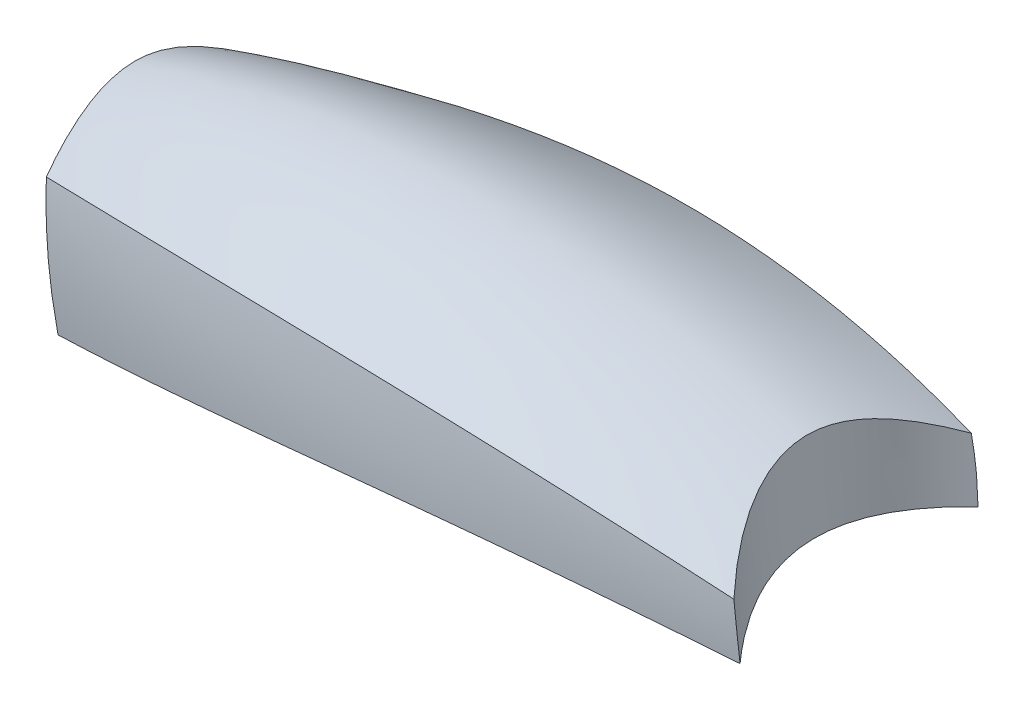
ISO-10303-21;
HEADER;
FILE_DESCRIPTION(('STEP AP214'),'2;1');
FILE_NAME('part.step','',(''),(''),'','','');
FILE_SCHEMA(('AUTOMOTIVE_DESIGN { 1 0 10303 214 1 1 1 1 }'));
ENDSEC;
DATA;
#1=APPLICATION_CONTEXT('core data for automotive mechanical design processes');
#2=APPLICATION_PROTOCOL_DEFINITION('international standard','automotive_design',2000,#1);
#3=PRODUCT_CONTEXT('',#1,'mechanical');
#4=PRODUCT('Part','Part','',(#3));
#5=PRODUCT_RELATED_PRODUCT_CATEGORY('part','',(#4));
#6=PRODUCT_DEFINITION_FORMATION('','',#4);
#7=PRODUCT_DEFINITION_CONTEXT('part definition',#1,'design');
#8=PRODUCT_DEFINITION('design','',#6,#7);
#9=PRODUCT_DEFINITION_SHAPE('','',#8);
#10=(LENGTH_UNIT() NAMED_UNIT(*) SI_UNIT(.MILLI.,.METRE.));
#11=(NAMED_UNIT(*) PLANE_ANGLE_UNIT() SI_UNIT($,.RADIAN.));
#12=(NAMED_UNIT(*) SI_UNIT($,.STERADIAN.) SOLID_ANGLE_UNIT());
#13=UNCERTAINTY_MEASURE_WITH_UNIT(LENGTH_MEASURE(1.E-05),#10,'distance_accuracy_value','');
#14=(GEOMETRIC_REPRESENTATION_CONTEXT(3) GLOBAL_UNCERTAINTY_ASSIGNED_CONTEXT((#13)) GLOBAL_UNIT_ASSIGNED_CONTEXT((#10,
#11,#12)) REPRESENTATION_CONTEXT('',''));
#15=CARTESIAN_POINT('',(0.,0.,0.));
#16=DIRECTION('',(0.,0.,1.));
#17=DIRECTION('',(1.,0.,0.));
#18=AXIS2_PLACEMENT_3D('',#15,#16,#17);
#19=CARTESIAN_POINT('',(-104.799318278,-20.186726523,-50.));
#20=CARTESIAN_POINT('',(-106.777576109,-3.776240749,-33.333333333));
#21=CARTESIAN_POINT('',(-110.73409177,29.0447308,0.));
#22=CARTESIAN_POINT('',(-106.777576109,-3.776240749,33.333333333));
#23=CARTESIAN_POINT('',(-104.799318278,-20.186726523,50.));
#24=CARTESIAN_POINT('',(-20.847006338,30.540577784,-50.));
#25=CARTESIAN_POINT('',(-21.200499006,41.39451757,-33.333333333));
#26=CARTESIAN_POINT('',(-21.907484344,63.102397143,0.));
#27=CARTESIAN_POINT('',(-21.200499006,41.39451757,33.333333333));
#28=CARTESIAN_POINT('',(-20.847006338,30.540577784,50.));
#29=CARTESIAN_POINT('',(84.282820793,27.882625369,-50.));
#30=CARTESIAN_POINT('',(80.626629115,34.535142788,-33.333333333));
#31=CARTESIAN_POINT('',(73.314245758,47.840177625,0.));
#32=CARTESIAN_POINT('',(80.626629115,34.535142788,33.333333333));
#33=CARTESIAN_POINT('',(84.282820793,27.882625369,50.));
#34=CARTESIAN_POINT('',(175.093841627,0.,-50.));
#35=CARTESIAN_POINT('',(169.932726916,6.317122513,-33.333333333));
#36=CARTESIAN_POINT('',(159.610497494,18.951367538,0.));
#37=CARTESIAN_POINT('',(169.932726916,6.317122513,33.333333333));
#38=CARTESIAN_POINT('',(175.093841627,0.,50.));
#39=B_SPLINE_SURFACE_WITH_KNOTS('',3,3,((#19,#20,#21,#22,#23),(#24,#25,#26,#27,#28),(#29,#30,
#31,#32,#33),(#34,#35,#36,#37,#38)),.UNSPECIFIED.,.F.,.F.,.F.,(4,4),(4,1,4),(0.,1.),(0.,0.5,1.),.UNSPECIFIED.);
#40=CARTESIAN_POINT('',(-65.8708399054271,-0.931042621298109,-50.));
#41=CARTESIAN_POINT('',(-66.3932527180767,-0.441353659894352,-49.2069320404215));
#42=CARTESIAN_POINT('',(-66.9045934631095,0.0568576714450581,-48.4118919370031));
#43=CARTESIAN_POINT('',(-67.9069207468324,1.06908328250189,-46.8145742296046));
#44=CARTESIAN_POINT('',(-68.3978387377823,1.58314205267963,-46.0122817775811));
#45=CARTESIAN_POINT('',(-69.3590834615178,2.62406255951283,-44.4000409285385));
#46=CARTESIAN_POINT('',(-69.8293540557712,3.15095379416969,-43.5900781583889));
#47=CARTESIAN_POINT('',(-70.7490804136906,4.21432737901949,-41.9619077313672));
#48=CARTESIAN_POINT('',(-71.1984939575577,4.75082637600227,-41.1436871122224));
#49=CARTESIAN_POINT('',(-72.0762784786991,5.82999793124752,-39.4982865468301));
#50=CARTESIAN_POINT('',(-72.5046220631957,6.37267745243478,-38.6710965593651));
#51=CARTESIAN_POINT('',(-73.3400238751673,7.46055754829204,-37.0068811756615));
#52=CARTESIAN_POINT('',(-73.7470697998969,8.00575938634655,-36.1698504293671));
#53=CARTESIAN_POINT('',(-74.5620135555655,9.12556001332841,-34.4372565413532));
#54=CARTESIAN_POINT('',(-74.9686634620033,9.70008168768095,-33.5410556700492));
#55=CARTESIAN_POINT('',(-75.7575963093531,10.842676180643,-31.73482228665));
#56=CARTESIAN_POINT('',(-76.1398945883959,11.4107528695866,-30.8247989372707));
#57=CARTESIAN_POINT('',(-76.8796850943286,12.5350251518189,-28.9890009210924));
#58=CARTESIAN_POINT('',(-77.2372042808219,13.0912331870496,-28.0632447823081));
#59=CARTESIAN_POINT('',(-77.926876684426,14.1857339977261,-26.1936545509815));
#60=CARTESIAN_POINT('',(-78.2590629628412,14.7240495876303,-25.2498461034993));
#61=CARTESIAN_POINT('',(-78.8973440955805,15.7759450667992,-23.3413349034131));
#62=CARTESIAN_POINT('',(-79.203468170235,16.289552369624,-22.376657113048));
#63=CARTESIAN_POINT('',(-79.7887205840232,17.2842706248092,-20.4228167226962));
#64=CARTESIAN_POINT('',(-80.0678564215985,17.765390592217,-19.4336610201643));
#65=CARTESIAN_POINT('',(-80.4605893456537,18.4474388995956,-17.9464974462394));
#66=CARTESIAN_POINT('',(-80.5851886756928,18.664678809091,-17.4588328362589));
#67=CARTESIAN_POINT('',(-80.8274736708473,19.087949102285,-16.4768399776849));
#68=CARTESIAN_POINT('',(-80.9451581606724,19.2939775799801,-15.9825106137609));
#69=CARTESIAN_POINT('',(-81.173327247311,19.6933685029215,-14.9870708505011));
#70=CARTESIAN_POINT('',(-81.2838114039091,19.8867301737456,-14.4859600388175));
#71=CARTESIAN_POINT('',(-81.4972937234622,20.259249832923,-13.4767906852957));
#72=CARTESIAN_POINT('',(-81.6002905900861,20.4384053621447,-12.9687309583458));
#73=CARTESIAN_POINT('',(-81.7975376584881,20.7792114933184,-11.9504668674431));
#74=CARTESIAN_POINT('',(-81.8918598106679,20.9410083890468,-11.4403255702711));
#75=CARTESIAN_POINT('',(-82.0724821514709,21.2472248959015,-10.4133998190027));
#76=CARTESIAN_POINT('',(-82.1587819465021,21.3916436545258,-9.8966150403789));
#77=CARTESIAN_POINT('',(-82.3229872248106,21.6612229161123,-8.85679594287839));
#78=CARTESIAN_POINT('',(-82.4008940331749,21.7863864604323,-8.3337626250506));
#79=CARTESIAN_POINT('',(-82.5479721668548,22.0155696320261,-7.28182817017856));
#80=CARTESIAN_POINT('',(-82.6171434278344,22.1195891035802,-6.75292698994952));
#81=CARTESIAN_POINT('',(-82.734352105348,22.28730783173,-5.78906653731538));
#82=CARTESIAN_POINT('',(-82.7839256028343,22.3549085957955,-5.35497125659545));
#83=CARTESIAN_POINT('',(-82.8768855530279,22.4738129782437,-4.48388523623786));
#84=CARTESIAN_POINT('',(-82.9202721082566,22.5251168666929,-4.04689454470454));
#85=CARTESIAN_POINT('',(-83.0006961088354,22.6104479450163,-3.17074609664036));
#86=CARTESIAN_POINT('',(-83.0377350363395,22.6444791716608,-2.73158887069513));
#87=CARTESIAN_POINT('',(-83.1053476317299,22.6943857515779,-1.85181588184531));
#88=CARTESIAN_POINT('',(-83.1359227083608,22.7102650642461,-1.41120045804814));
#89=CARTESIAN_POINT('',(-83.1768626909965,22.7199067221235,-0.750072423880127));
#90=CARTESIAN_POINT('',(-83.1896826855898,22.7207614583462,-0.529794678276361));
#91=CARTESIAN_POINT('',(-83.213687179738,22.7176646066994,-0.0891840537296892));
#92=CARTESIAN_POINT('',(-83.224871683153,22.7137130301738,0.131148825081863));
#93=CARTESIAN_POINT('',(-83.2559699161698,22.6946552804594,0.792131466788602));
#94=CARTESIAN_POINT('',(-83.2734249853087,22.6723452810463,1.23271057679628));
#95=CARTESIAN_POINT('',(-83.3017984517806,22.6092292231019,2.11281319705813));
#96=CARTESIAN_POINT('',(-83.3127155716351,22.5684195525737,2.55233648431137));
#97=CARTESIAN_POINT('',(-83.3280831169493,22.4691109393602,3.42948602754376));
#98=CARTESIAN_POINT('',(-83.3325334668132,22.4106117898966,3.86711226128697));
#99=CARTESIAN_POINT('',(-83.335416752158,22.2592510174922,4.85449752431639));
#100=CARTESIAN_POINT('',(-83.3319609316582,22.1613991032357,5.40350060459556));
#101=CARTESIAN_POINT('',(-83.3152269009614,21.9408918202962,6.49640163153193));
#102=CARTESIAN_POINT('',(-83.3019470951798,21.8182324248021,7.04029873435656));
#103=CARTESIAN_POINT('',(-83.2659278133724,21.5501227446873,8.1222672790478));
#104=CARTESIAN_POINT('',(-83.2431856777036,21.4046660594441,8.66033703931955));
#105=CARTESIAN_POINT('',(-83.1886441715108,21.0930253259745,9.72992441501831));
#106=CARTESIAN_POINT('',(-83.1568451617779,20.9268421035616,10.2614422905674));
#107=CARTESIAN_POINT('',(-83.0841090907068,20.5733099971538,11.3248394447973));
#108=CARTESIAN_POINT('',(-83.0430531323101,20.3857029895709,11.8566244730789));
#109=CARTESIAN_POINT('',(-82.9524961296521,19.9931953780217,12.912864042));
#110=CARTESIAN_POINT('',(-82.9029972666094,19.7882992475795,13.4373204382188));
#111=CARTESIAN_POINT('',(-82.7959615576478,19.3630019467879,14.4789865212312));
#112=CARTESIAN_POINT('',(-82.7384256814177,19.1426026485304,14.9961970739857));
#113=CARTESIAN_POINT('',(-82.6157123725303,18.6880039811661,16.0234005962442));
#114=CARTESIAN_POINT('',(-82.5505370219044,18.4538083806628,16.5333954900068));
#115=CARTESIAN_POINT('',(-82.3496049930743,17.7520920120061,18.0123057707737));
#116=CARTESIAN_POINT('',(-82.2040469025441,17.2680110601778,18.9720696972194));
#117=CARTESIAN_POINT('',(-81.8882082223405,16.2637988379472,20.8684565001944));
#118=CARTESIAN_POINT('',(-81.7179218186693,15.7436591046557,21.8050738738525));
#119=CARTESIAN_POINT('',(-81.3541538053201,14.6744438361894,23.6586573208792));
#120=CARTESIAN_POINT('',(-81.1606419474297,14.1253311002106,24.5755958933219));
#121=CARTESIAN_POINT('',(-80.7516454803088,13.0043873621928,26.3925432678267));
#122=CARTESIAN_POINT('',(-80.5361256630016,12.432520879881,27.2925221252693));
#123=CARTESIAN_POINT('',(-80.0840935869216,11.2715639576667,29.0777997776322));
#124=CARTESIAN_POINT('',(-79.8475519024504,10.6824501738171,29.9630758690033));
#125=CARTESIAN_POINT('',(-79.3542756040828,9.49195883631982,31.7208139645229));
#126=CARTESIAN_POINT('',(-79.0975233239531,8.89057090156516,32.5932639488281));
#127=CARTESIAN_POINT('',(-78.5824279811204,7.72082310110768,34.268554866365));
#128=CARTESIAN_POINT('',(-78.3253513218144,7.15295958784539,35.0721336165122));
#129=CARTESIAN_POINT('',(-77.7946547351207,6.01394711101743,36.6705829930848));
#130=CARTESIAN_POINT('',(-77.5210459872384,5.44280059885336,37.4654590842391));
#131=CARTESIAN_POINT('',(-76.9577070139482,4.30052676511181,39.0473337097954));
#132=CARTESIAN_POINT('',(-76.6680040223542,3.72940095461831,39.8343430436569));
#133=CARTESIAN_POINT('',(-76.0728559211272,2.59030990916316,41.4011804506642));
#134=CARTESIAN_POINT('',(-75.7674548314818,2.02234030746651,42.1810220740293));
#135=CARTESIAN_POINT('',(-75.1412661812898,0.89256387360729,43.7341129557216));
#136=CARTESIAN_POINT('',(-74.8205398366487,0.330742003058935,44.5073759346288));
#137=CARTESIAN_POINT('',(-74.1640179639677,-0.783864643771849,46.0477729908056));
#138=CARTESIAN_POINT('',(-73.8283010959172,-1.33667963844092,46.8149187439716));
#139=CARTESIAN_POINT('',(-73.4842482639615,-1.88517079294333,47.5814400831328));
#140=B_SPLINE_CURVE_WITH_KNOTS('',3,(#40,#41,#42,#43,#44,#45,#46,#47,#48,#49,#50,#51,#52,#53,
#54,#55,#56,#57,#58,#59,#60,#61,#62,#63,#64,#65,#66,#67,#68,#69,#70,#71,#72,#73,#74,#75,#76,#77,
#78,#79,#80,#81,#82,#83,#84,#85,#86,#87,#88,#89,#90,#91,#92,#93,#94,#95,#96,#97,#98,#99,#100,
#101,#102,#103,#104,#105,#106,#107,#108,#109,#110,#111,#112,#113,#114,#115,#116,#117,#118,#119,
#120,#121,#122,#123,#124,#125,#126,#127,#128,#129,#130,#131,#132,#133,#134,#135,#136,#137,#138,
#139),.UNSPECIFIED.,.F.,.F.,(4,2,2,2,2,2,2,2,2,2,2,2,2,2,2,2,2,2,2,2,2,2,2,2,2,2,2,2,2,2,2,2,2,
2,2,2,2,2,2,2,2,2,2,2,2,2,2,2,2,4),(0.,3.20530898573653,6.42062738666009,9.64420589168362,
12.8740479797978,16.10798379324,19.3437675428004,22.7621338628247,26.178325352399,
29.5907397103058,32.9986215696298,36.4026308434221,39.8056916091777,41.4501624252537,
43.0949119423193,44.7397619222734,46.3848960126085,48.0148471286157,49.6448781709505,
51.2746514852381,52.9044368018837,54.2304599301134,55.556461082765,56.8821521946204,
58.2075540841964,58.8694600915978,59.5313645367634,60.8553375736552,62.1795692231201,
63.5038163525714,65.1760789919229,66.84861329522,68.5216180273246,70.1945561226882,
71.8903475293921,73.5857014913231,75.2808510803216,76.975539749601,80.2282761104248,
83.481778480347,86.7395650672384,90.0026475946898,93.2703718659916,96.5409848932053,
99.5918081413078,102.640590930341,105.684363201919,108.72002211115,111.744431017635,
114.754499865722),.UNSPECIFIED.);
#141=CARTESIAN_POINT('',(-73.8828729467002,8.19439127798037,-35.8770991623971));
#142=VERTEX_POINT('',#141);
#143=CARTESIAN_POINT('',(-79.3769772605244,9.55168766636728,31.6285765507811));
#144=VERTEX_POINT('',#143);
#145=EDGE_CURVE('E85',#142,#144,#140,.T.);
#146=CARTESIAN_POINT('',(-107.566674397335,2.76966344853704,24.4653737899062));
#147=CARTESIAN_POINT('',(-106.34099896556,3.11078784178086,24.8146085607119));
#148=CARTESIAN_POINT('',(-105.112361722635,3.44578977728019,25.159398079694));
#149=CARTESIAN_POINT('',(-102.649532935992,4.10407383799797,25.8401598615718));
#150=CARTESIAN_POINT('',(-101.415341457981,4.42735610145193,26.1761322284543));
#151=CARTESIAN_POINT('',(-98.9422359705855,5.06260772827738,26.8392094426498));
#152=CARTESIAN_POINT('',(-97.7033240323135,5.37458153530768,27.1663177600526));
#153=CARTESIAN_POINT('',(-95.2206010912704,5.98780703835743,27.8118693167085));
#154=CARTESIAN_POINT('',(-93.9767900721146,6.28905869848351,28.1303125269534));
#155=CARTESIAN_POINT('',(-90.238927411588,7.17724726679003,29.0726090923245));
#156=CARTESIAN_POINT('',(-87.7379292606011,7.74875011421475,29.6835678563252));
#157=CARTESIAN_POINT('',(-82.7196363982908,8.85329982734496,30.8714117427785));
#158=CARTESIAN_POINT('',(-80.2023428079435,9.38634930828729,31.4482991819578));
#159=CARTESIAN_POINT('',(-75.1528822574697,10.4161541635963,32.5683569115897));
#160=CARTESIAN_POINT('',(-72.6207153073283,10.9129095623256,33.111527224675));
#161=CARTESIAN_POINT('',(-67.5432853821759,11.8716323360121,34.1643211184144));
#162=CARTESIAN_POINT('',(-64.9980244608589,12.3336049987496,34.673949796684));
#163=CARTESIAN_POINT('',(-59.8950364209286,13.2240012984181,35.6600027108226));
#164=CARTESIAN_POINT('',(-57.3373083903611,13.6524224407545,36.13642447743));
#165=CARTESIAN_POINT('',(-52.2104857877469,14.4764423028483,37.0562399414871));
#166=CARTESIAN_POINT('',(-49.641390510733,14.8720389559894,37.4996315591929));
#167=CARTESIAN_POINT('',(-44.4928772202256,15.6308128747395,38.3535399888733));
#168=CARTESIAN_POINT('',(-41.9134588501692,15.9939890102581,38.7640556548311));
#169=CARTESIAN_POINT('',(-36.7453090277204,16.6880601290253,39.552350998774));
#170=CARTESIAN_POINT('',(-34.1565776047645,17.0189552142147,39.9301307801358));
#171=CARTESIAN_POINT('',(-28.569812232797,17.6970636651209,40.7089849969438));
#172=CARTESIAN_POINT('',(-25.5703653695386,18.0388929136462,41.1046334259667));
#173=CARTESIAN_POINT('',(-19.5616695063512,18.6790590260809,41.8526776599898));
#174=CARTESIAN_POINT('',(-16.5524211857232,18.9773988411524,42.2050763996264));
#175=CARTESIAN_POINT('',(-10.5253330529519,19.5299985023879,42.8668319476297));
#176=CARTESIAN_POINT('',(-7.50749375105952,19.7842609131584,43.1761912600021));
#177=CARTESIAN_POINT('',(-1.46442883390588,20.2479522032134,43.7520606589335));
#178=CARTESIAN_POINT('',(1.56079644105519,20.457383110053,44.0185726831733));
#179=CARTESIAN_POINT('',(7.61744048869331,20.8305439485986,44.5089226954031));
#180=CARTESIAN_POINT('',(10.6488590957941,20.9942750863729,44.7327618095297));
#181=CARTESIAN_POINT('',(16.716796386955,21.2751019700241,45.1379271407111));
#182=CARTESIAN_POINT('',(19.7533152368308,21.3921961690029,45.3192519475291));
#183=CARTESIAN_POINT('',(25.8303710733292,21.5787699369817,45.6395207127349));
#184=CARTESIAN_POINT('',(28.8709084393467,21.6482446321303,45.7784603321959));
#185=CARTESIAN_POINT('',(34.9548821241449,21.7385836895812,46.014056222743));
#186=CARTESIAN_POINT('',(37.9983188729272,21.7594391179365,46.1107047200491));
#187=CARTESIAN_POINT('',(45.4263600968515,21.7498023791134,46.2950116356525));
#188=CARTESIAN_POINT('',(49.8115447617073,21.6926627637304,46.3599804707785));
#189=CARTESIAN_POINT('',(58.5807068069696,21.472705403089,46.402419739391));
#190=CARTESIAN_POINT('',(62.9646836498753,21.3098624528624,46.379869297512));
#191=CARTESIAN_POINT('',(71.7264433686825,20.8759836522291,46.2471895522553));
#192=CARTESIAN_POINT('',(76.1042255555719,20.6049365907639,46.1370511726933));
#193=CARTESIAN_POINT('',(84.8485531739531,19.9525507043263,45.8289679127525));
#194=CARTESIAN_POINT('',(89.2150984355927,19.5712102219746,45.6310217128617));
#195=CARTESIAN_POINT('',(97.9319499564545,18.6966436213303,45.1468831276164));
#196=CARTESIAN_POINT('',(102.282256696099,18.2034208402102,44.8606933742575));
#197=CARTESIAN_POINT('',(110.980756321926,17.1016817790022,44.1978803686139));
#198=CARTESIAN_POINT('',(115.32885715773,16.4926718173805,43.8208679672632));
#199=CARTESIAN_POINT('',(123.998604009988,15.1605510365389,42.9759605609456));
#200=CARTESIAN_POINT('',(128.320250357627,14.4374416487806,42.508066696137));
#201=CARTESIAN_POINT('',(136.932412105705,12.8777495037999,41.4797636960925));
#202=CARTESIAN_POINT('',(141.222925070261,12.0411579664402,40.9193474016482));
#203=CARTESIAN_POINT('',(147.631381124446,10.7026379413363,40.0077459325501));
#204=CARTESIAN_POINT('',(149.763229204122,10.2424669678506,39.6920080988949));
#205=CARTESIAN_POINT('',(154.017130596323,9.29463902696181,39.0365459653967));
#206=CARTESIAN_POINT('',(156.139183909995,8.80698206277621,38.6968216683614));
#207=CARTESIAN_POINT('',(160.373550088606,7.80447835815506,37.9929221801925));
#208=CARTESIAN_POINT('',(162.485859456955,7.28962257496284,37.6287388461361));
#209=CARTESIAN_POINT('',(166.69942851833,6.23346608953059,36.8756215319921));
#210=CARTESIAN_POINT('',(168.800688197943,5.69216535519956,36.4866875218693));
#211=CARTESIAN_POINT('',(170.896123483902,5.13794040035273,36.0851780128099));
#212=B_SPLINE_CURVE_WITH_KNOTS('',3,(#146,#147,#148,#149,#150,#151,#152,#153,#154,#155,#156,
#157,#158,#159,#160,#161,#162,#163,#164,#165,#166,#167,#168,#169,#170,#171,#172,#173,#174,#175,
#176,#177,#178,#179,#180,#181,#182,#183,#184,#185,#186,#187,#188,#189,#190,#191,#192,#193,#194,
#195,#196,#197,#198,#199,#200,#201,#202,#203,#204,#205,#206,#207,#208,#209,#210,#211),
.UNSPECIFIED.,.F.,.F.,(4,2,2,2,2,2,2,2,2,2,2,2,2,2,2,2,2,2,2,2,2,2,2,2,2,2,2,2,2,2,2,2,4),(0.,
3.95792927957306,7.91581185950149,11.87212194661,15.8284452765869,23.7394385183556,
31.6498932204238,39.5603426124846,47.4695869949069,55.3794188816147,63.2897483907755,
71.200353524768,79.1109336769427,88.2443190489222,97.3770843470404,106.509318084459,
115.641138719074,124.772718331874,133.904600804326,143.037417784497,152.171912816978,
165.327799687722,178.486824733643,191.647213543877,204.807800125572,217.967994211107,
231.185611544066,244.403063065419,257.621537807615,264.232325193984,270.843111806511,
277.456110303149,284.069116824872),.UNSPECIFIED.);
#213=CARTESIAN_POINT('',(138.833024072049,12.4922172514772,41.2192245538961));
#214=VERTEX_POINT('',#213);
#215=EDGE_CURVE('E59',#144,#214,#212,.T.);
#216=CARTESIAN_POINT('',(145.338166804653,8.78734610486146,47.8554946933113));
#217=CARTESIAN_POINT('',(144.745030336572,9.11387771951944,47.2902369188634));
#218=CARTESIAN_POINT('',(144.156674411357,9.44068201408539,46.7200968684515));
#219=CARTESIAN_POINT('',(142.988374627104,10.0954574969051,45.567728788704));
#220=CARTESIAN_POINT('',(142.40846280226,10.4234291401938,44.985468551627));
#221=CARTESIAN_POINT('',(141.25829432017,11.0798704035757,43.808708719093));
#222=CARTESIAN_POINT('',(140.688062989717,11.4083394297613,43.2141840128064));
#223=CARTESIAN_POINT('',(139.558536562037,12.0650247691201,42.0126785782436));
#224=CARTESIAN_POINT('',(138.999259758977,12.3932399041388,41.4056799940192));
#225=CARTESIAN_POINT('',(137.892949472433,13.0486011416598,40.1789459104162));
#226=CARTESIAN_POINT('',(137.345926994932,13.3757460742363,39.5591998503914));
#227=CARTESIAN_POINT('',(136.265446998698,14.0280694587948,38.3066344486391));
#228=CARTESIAN_POINT('',(135.731993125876,14.3532473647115,37.6738116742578));
#229=CARTESIAN_POINT('',(134.667546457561,15.0083142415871,36.3795467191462));
#230=CARTESIAN_POINT('',(134.136904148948,15.3381350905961,35.7177813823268));
#231=CARTESIAN_POINT('',(133.092691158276,15.9935573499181,34.3795045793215));
#232=CARTESIAN_POINT('',(132.579111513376,16.3191609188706,33.7030011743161));
#233=CARTESIAN_POINT('',(131.570587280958,16.9648707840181,32.3345492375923));
#234=CARTESIAN_POINT('',(131.075629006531,17.2849810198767,31.6426126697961));
#235=CARTESIAN_POINT('',(130.106017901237,17.9182772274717,30.24245163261));
#236=CARTESIAN_POINT('',(129.631349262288,18.2314684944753,29.5342405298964));
#237=CARTESIAN_POINT('',(128.704079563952,18.8493245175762,28.1005552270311));
#238=CARTESIAN_POINT('',(128.251465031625,19.1539944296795,27.3750919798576));
#239=CARTESIAN_POINT('',(127.370203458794,19.7530159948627,25.9056996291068));
#240=CARTESIAN_POINT('',(126.941552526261,20.0473693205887,25.1617735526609));
#241=CARTESIAN_POINT('',(126.253769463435,20.5242484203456,23.914226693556));
#242=CARTESIAN_POINT('',(125.987112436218,20.7103634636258,23.4161142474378));
#243=CARTESIAN_POINT('',(125.465870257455,21.07647768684,22.4113196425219));
#244=CARTESIAN_POINT('',(125.211286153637,21.2564763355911,21.904636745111));
#245=CARTESIAN_POINT('',(124.715046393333,21.6095368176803,20.8825852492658));
#246=CARTESIAN_POINT('',(124.47339078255,21.7825986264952,20.3672166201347));
#247=CARTESIAN_POINT('',(124.003873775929,22.1209190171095,19.3276450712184));
#248=CARTESIAN_POINT('',(123.776013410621,22.2861770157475,18.8034414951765));
#249=CARTESIAN_POINT('',(123.335831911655,22.6073617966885,17.7480005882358));
#250=CARTESIAN_POINT('',(123.123460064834,22.763318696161,17.2167936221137));
#251=CARTESIAN_POINT('',(122.714393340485,23.0654928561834,16.1455997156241));
#252=CARTESIAN_POINT('',(122.517699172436,23.2117096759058,15.6056123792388));
#253=CARTESIAN_POINT('',(122.14105671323,23.4932900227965,14.5170346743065));
#254=CARTESIAN_POINT('',(121.961108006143,23.6286538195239,13.9684445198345));
#255=CARTESIAN_POINT('',(121.619011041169,23.8873837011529,12.8628367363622));
#256=CARTESIAN_POINT('',(121.45686542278,24.0107480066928,12.3058178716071));
#257=CARTESIAN_POINT('',(121.148798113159,24.2463067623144,11.1739105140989));
#258=CARTESIAN_POINT('',(121.003214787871,24.3582645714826,10.5988802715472));
#259=CARTESIAN_POINT('',(120.732825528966,24.5671526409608,9.44118220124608));
#260=CARTESIAN_POINT('',(120.608021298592,24.6640816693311,8.85851375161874));
#261=CARTESIAN_POINT('',(120.380333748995,24.8415698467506,7.6864823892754));
#262=CARTESIAN_POINT('',(120.277448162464,24.9221306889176,7.09712017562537));
#263=CARTESIAN_POINT('',(120.094597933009,25.0656156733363,5.91268119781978));
#264=CARTESIAN_POINT('',(120.014633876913,25.1285393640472,5.31760428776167));
#265=CARTESIAN_POINT('',(119.878699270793,25.2354247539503,4.12438141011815));
#266=CARTESIAN_POINT('',(119.822675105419,25.2794288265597,3.52624536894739));
#267=CARTESIAN_POINT('',(119.735036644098,25.3476325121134,2.32693738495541));
#268=CARTESIAN_POINT('',(119.703425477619,25.3718295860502,1.72576506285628));
#269=CARTESIAN_POINT('',(119.674674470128,25.3926258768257,0.823145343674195));
#270=CARTESIAN_POINT('',(119.668201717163,25.3969748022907,0.52213286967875));
#271=CARTESIAN_POINT('',(119.661508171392,25.40041232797,-0.0799871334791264));
#272=CARTESIAN_POINT('',(119.661287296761,25.3995009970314,-0.381094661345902));
#273=CARTESIAN_POINT('',(119.670017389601,25.388932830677,-1.28407924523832));
#274=CARTESIAN_POINT('',(119.688354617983,25.3714464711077,-1.88582059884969));
#275=CARTESIAN_POINT('',(119.745171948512,25.3205406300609,-2.99561271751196));
#276=CARTESIAN_POINT('',(119.780161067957,25.2899516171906,-3.50398235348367));
#277=CARTESIAN_POINT('',(119.867723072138,25.2148755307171,-4.51819634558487));
#278=CARTESIAN_POINT('',(119.920297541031,25.1703872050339,-5.02404047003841));
#279=CARTESIAN_POINT('',(120.103834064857,25.0170494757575,-6.536257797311));
#280=CARTESIAN_POINT('',(120.260626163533,24.8883117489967,-7.53763946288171));
#281=CARTESIAN_POINT('',(120.63908805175,24.5836165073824,-9.52212579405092));
#282=CARTESIAN_POINT('',(120.86086116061,24.4075838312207,-10.5051986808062));
#283=CARTESIAN_POINT('',(121.364145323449,24.0148076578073,-12.4476636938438));
#284=CARTESIAN_POINT('',(121.645663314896,23.7980594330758,-13.4070530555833));
#285=CARTESIAN_POINT('',(122.189069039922,23.3860803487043,-15.0736532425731));
#286=CARTESIAN_POINT('',(122.439612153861,23.1980560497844,-15.7864130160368));
#287=CARTESIAN_POINT('',(122.96965948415,22.8046496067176,-17.1964570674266));
#288=CARTESIAN_POINT('',(123.249172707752,22.5992620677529,-17.8937364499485));
#289=CARTESIAN_POINT('',(123.834908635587,22.1735062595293,-19.2725978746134));
#290=CARTESIAN_POINT('',(124.14114128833,21.9531324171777,-19.9541739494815));
#291=CARTESIAN_POINT('',(124.778041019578,21.4996467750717,-21.3014324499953));
#292=CARTESIAN_POINT('',(125.108707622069,21.2665352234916,-21.967115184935));
#293=CARTESIAN_POINT('',(125.794547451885,20.7880555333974,-23.2868691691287));
#294=CARTESIAN_POINT('',(126.149857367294,20.5426215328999,-23.9408452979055));
#295=CARTESIAN_POINT('',(126.881192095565,20.0426268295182,-25.2332291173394));
#296=CARTESIAN_POINT('',(127.257210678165,19.7880688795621,-25.8716414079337));
#297=CARTESIAN_POINT('',(128.028363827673,19.2712898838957,-27.1335601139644));
#298=CARTESIAN_POINT('',(128.423497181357,19.0090693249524,-27.757067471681));
#299=CARTESIAN_POINT('',(129.231340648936,18.4782922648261,-28.9897350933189));
#300=CARTESIAN_POINT('',(129.644049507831,18.2097362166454,-29.5988963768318));
#301=CARTESIAN_POINT('',(130.593854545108,17.597732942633,-30.9582967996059));
#302=CARTESIAN_POINT('',(131.135662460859,17.2527742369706,-31.7045647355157));
#303=CARTESIAN_POINT('',(132.242581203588,16.556539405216,-33.1766783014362));
#304=CARTESIAN_POINT('',(132.807694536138,16.2052626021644,-33.9025217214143));
#305=CARTESIAN_POINT('',(133.959322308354,15.4978869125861,-35.3351356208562));
#306=CARTESIAN_POINT('',(134.545845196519,15.1417861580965,-36.0418983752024));
#307=CARTESIAN_POINT('',(135.738493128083,14.4260661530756,-37.437490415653));
#308=CARTESIAN_POINT('',(136.344627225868,14.0664453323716,-38.126311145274));
#309=CARTESIAN_POINT('',(137.574825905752,13.3448185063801,-39.4869742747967));
#310=CARTESIAN_POINT('',(138.198896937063,12.9828116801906,-40.1588104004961));
#311=CARTESIAN_POINT('',(139.448526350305,12.2659365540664,-41.4706839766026));
#312=CARTESIAN_POINT('',(140.073708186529,11.911099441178,-42.1110976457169));
#313=CARTESIAN_POINT('',(141.338282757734,11.2009097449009,-43.3771031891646));
#314=CARTESIAN_POINT('',(141.977672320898,10.8455572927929,-44.0026983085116));
#315=CARTESIAN_POINT('',(143.269283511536,10.1350686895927,-45.2395630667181));
#316=CARTESIAN_POINT('',(143.921495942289,9.77993255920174,-45.8508423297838));
#317=CARTESIAN_POINT('',(145.237388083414,9.07053068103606,-47.0595066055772));
#318=CARTESIAN_POINT('',(145.901052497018,8.71626440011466,-47.6569079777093));
#319=CARTESIAN_POINT('',(147.238543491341,8.00916442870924,-48.8381507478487));
#320=CARTESIAN_POINT('',(147.912348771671,7.65632929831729,-49.4220153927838));
#321=CARTESIAN_POINT('',(148.591419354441,7.30404966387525,-50.));
#322=B_SPLINE_CURVE_WITH_KNOTS('',3,(#216,#217,#218,#219,#220,#221,#222,#223,#224,#225,#226,
#227,#228,#229,#230,#231,#232,#233,#234,#235,#236,#237,#238,#239,#240,#241,#242,#243,#244,#245,
#246,#247,#248,#249,#250,#251,#252,#253,#254,#255,#256,#257,#258,#259,#260,#261,#262,#263,#264,
#265,#266,#267,#268,#269,#270,#271,#272,#273,#274,#275,#276,#277,#278,#279,#280,#281,#282,#283,
#284,#285,#286,#287,#288,#289,#290,#291,#292,#293,#294,#295,#296,#297,#298,#299,#300,#301,#302,
#303,#304,#305,#306,#307,#308,#309,#310,#311,#312,#313,#314,#315,#316,#317,#318,#319,#320,#321),
.UNSPECIFIED.,.F.,.F.,(4,2,2,2,2,2,2,2,2,2,2,2,2,2,2,2,2,2,2,2,2,2,2,2,2,2,2,2,2,2,2,2,2,2,2,2,
2,2,2,2,2,2,2,2,2,2,2,2,2,2,2,2,4),(0.,2.64604022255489,5.30034950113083,7.96077492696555,
10.6253183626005,13.2921660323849,15.9597228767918,18.6897782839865,21.4183761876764,
24.1449277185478,26.8693147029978,29.5920159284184,32.3142736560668,34.0986718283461,
35.8832245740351,37.6677836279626,39.4524758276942,41.231034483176,43.0096735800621,
44.7882684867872,46.5671267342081,48.3775034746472,50.1880285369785,51.9983662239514,
53.8087502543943,55.6150582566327,57.4215977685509,58.3248417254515,59.228073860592,
61.0339315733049,62.5649055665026,64.0960175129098,67.1572717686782,70.2234200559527,
73.2899245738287,75.6247185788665,77.9602406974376,80.2966361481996,82.6329860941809,
84.9835309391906,87.3333724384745,89.6830649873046,92.0325900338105,94.985857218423,
97.939442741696,100.894206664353,103.850354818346,106.807579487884,109.695602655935,
112.582987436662,115.468371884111,118.350162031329,121.226568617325),.UNSPECIFIED.);
#323=CARTESIAN_POINT('',(134.126131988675,15.3977055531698,-35.5302944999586));
#324=VERTEX_POINT('',#323);
#325=EDGE_CURVE('E77',#214,#324,#322,.T.);
#326=CARTESIAN_POINT('',(-83.0229440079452,6.58020006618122,-33.4914954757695));
#327=CARTESIAN_POINT('',(-81.9774505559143,6.767752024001,-33.7808881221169));
#328=CARTESIAN_POINT('',(-80.9303490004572,6.95452597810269,-34.0649694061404));
#329=CARTESIAN_POINT('',(-78.8330770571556,7.3266149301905,-34.6225536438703));
#330=CARTESIAN_POINT('',(-77.7829066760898,7.51192993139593,-34.8960566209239));
#331=CARTESIAN_POINT('',(-75.679988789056,7.88113759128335,-35.4324409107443));
#332=CARTESIAN_POINT('',(-74.6272422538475,8.06503070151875,-35.6953257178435));
#333=CARTESIAN_POINT('',(-72.5189621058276,8.43149324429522,-36.2106184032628));
#334=CARTESIAN_POINT('',(-71.4634284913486,8.61406267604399,-36.4630262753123));
#335=CARTESIAN_POINT('',(-68.2933184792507,9.15971729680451,-37.2044998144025));
#336=CARTESIAN_POINT('',(-66.1747273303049,9.52083753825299,-37.6779442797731));
#337=CARTESIAN_POINT('',(-61.9281289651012,10.2373986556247,-38.5835543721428));
#338=CARTESIAN_POINT('',(-59.8001231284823,10.5928403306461,-39.0157258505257));
#339=CARTESIAN_POINT('',(-55.5353453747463,11.2972514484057,-39.8393685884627));
#340=CARTESIAN_POINT('',(-53.3985741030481,11.6462213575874,-40.2308427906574));
#341=CARTESIAN_POINT('',(-49.1168962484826,12.3365702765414,-40.9737052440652));
#342=CARTESIAN_POINT('',(-46.9719898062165,12.6779494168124,-41.3250941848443));
#343=CARTESIAN_POINT('',(-42.6727882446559,13.3520482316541,-41.988734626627));
#344=CARTESIAN_POINT('',(-40.5184865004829,13.6847599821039,-42.3009512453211));
#345=CARTESIAN_POINT('',(-36.2029125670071,14.3396873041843,-42.8866116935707));
#346=CARTESIAN_POINT('',(-34.041640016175,14.6619023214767,-43.1600534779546));
#347=CARTESIAN_POINT('',(-29.7126967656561,15.2941914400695,-43.6689427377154));
#348=CARTESIAN_POINT('',(-27.5450256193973,15.6042646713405,-43.9043874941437));
#349=CARTESIAN_POINT('',(-23.2038568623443,16.2105563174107,-44.3381283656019));
#350=CARTESIAN_POINT('',(-21.030358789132,16.5067735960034,-44.5364214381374));
#351=CARTESIAN_POINT('',(-16.678103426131,17.0836053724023,-44.8967770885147));
#352=CARTESIAN_POINT('',(-14.4993457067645,17.3642185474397,-45.0588365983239));
#353=CARTESIAN_POINT('',(-10.1371717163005,17.9080856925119,-45.3477226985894));
#354=CARTESIAN_POINT('',(-7.95375508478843,18.1713382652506,-45.4745464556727));
#355=CARTESIAN_POINT('',(-2.24004579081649,18.8346195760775,-45.7614562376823));
#356=CARTESIAN_POINT('',(1.29345594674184,19.2192951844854,-45.8940951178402));
#357=CARTESIAN_POINT('',(8.3688574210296,19.931755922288,-46.0753036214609));
#358=CARTESIAN_POINT('',(11.9107583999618,20.259532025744,-46.1238599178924));
#359=CARTESIAN_POINT('',(19.0006025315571,20.8514510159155,-46.1423706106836));
#360=CARTESIAN_POINT('',(22.5485464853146,21.115584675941,-46.1123136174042));
#361=CARTESIAN_POINT('',(29.6480257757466,21.573973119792,-45.9794556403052));
#362=CARTESIAN_POINT('',(33.1995615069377,21.7682191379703,-45.8766455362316));
#363=CARTESIAN_POINT('',(40.3037570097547,22.0812182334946,-45.6043848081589));
#364=CARTESIAN_POINT('',(43.8564168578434,22.1999638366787,-45.4349275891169));
#365=CARTESIAN_POINT('',(50.9603423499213,22.3570962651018,-45.0355132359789));
#366=CARTESIAN_POINT('',(54.5116078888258,22.395477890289,-44.8055521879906));
#367=CARTESIAN_POINT('',(61.6048094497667,22.3878856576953,-44.2914567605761));
#368=CARTESIAN_POINT('',(65.1467514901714,22.3420372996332,-44.007403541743));
#369=CARTESIAN_POINT('',(72.2241996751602,22.1632008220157,-43.3903438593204));
#370=CARTESIAN_POINT('',(75.7597057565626,22.030211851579,-43.0573369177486));
#371=CARTESIAN_POINT('',(82.8215012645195,21.6750786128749,-42.3471365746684));
#372=CARTESIAN_POINT('',(86.347791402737,21.4529414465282,-41.9699466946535));
#373=CARTESIAN_POINT('',(93.3883617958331,20.9185448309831,-41.1752554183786));
#374=CARTESIAN_POINT('',(96.9026440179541,20.6063009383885,-40.7577609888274));
#375=CARTESIAN_POINT('',(103.916339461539,19.8917539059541,-39.8853195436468));
#376=CARTESIAN_POINT('',(107.41575657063,19.4894760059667,-39.4303830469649));
#377=CARTESIAN_POINT('',(114.396928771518,18.5958589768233,-38.4848518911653));
#378=CARTESIAN_POINT('',(117.87869056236,18.1045567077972,-37.9942720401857));
#379=CARTESIAN_POINT('',(122.364297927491,17.4134066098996,-37.3378659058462));
#380=CARTESIAN_POINT('',(123.376783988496,17.2535540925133,-37.1880908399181));
#381=CARTESIAN_POINT('',(125.399998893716,16.9264754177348,-36.8855644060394));
#382=CARTESIAN_POINT('',(126.41072793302,16.7592501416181,-36.7328133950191));
#383=CARTESIAN_POINT('',(128.43040685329,16.417478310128,-36.4243305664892));
#384=CARTESIAN_POINT('',(129.439356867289,16.2429323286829,-36.2685989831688));
#385=CARTESIAN_POINT('',(131.455465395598,15.8865747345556,-35.9541420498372));
#386=CARTESIAN_POINT('',(132.462623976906,15.7047633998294,-35.7954168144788));
#387=CARTESIAN_POINT('',(134.474225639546,15.3341010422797,-35.4751007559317));
#388=CARTESIAN_POINT('',(135.478670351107,15.1452565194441,-35.3135126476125));
#389=CARTESIAN_POINT('',(137.485741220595,14.7604344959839,-34.9873112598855));
#390=CARTESIAN_POINT('',(138.488367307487,14.5644567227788,-34.8226978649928));
#391=CARTESIAN_POINT('',(140.491785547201,14.1654315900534,-34.4904228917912));
#392=CARTESIAN_POINT('',(141.492577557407,13.9623837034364,-34.3227610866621));
#393=CARTESIAN_POINT('',(143.492312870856,13.5492846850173,-33.9843642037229));
#394=CARTESIAN_POINT('',(144.491255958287,13.3392327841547,-33.8136287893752));
#395=CARTESIAN_POINT('',(145.489194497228,13.1257275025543,-33.641356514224));
#396=B_SPLINE_CURVE_WITH_KNOTS('',3,(#326,#327,#328,#329,#330,#331,#332,#333,#334,#335,#336,
#337,#338,#339,#340,#341,#342,#343,#344,#345,#346,#347,#348,#349,#350,#351,#352,#353,#354,#355,
#356,#357,#358,#359,#360,#361,#362,#363,#364,#365,#366,#367,#368,#369,#370,#371,#372,#373,#374,
#375,#376,#377,#378,#379,#380,#381,#382,#383,#384,#385,#386,#387,#388,#389,#390,#391,#392,#393,
#394,#395),.UNSPECIFIED.,.F.,.F.,(4,2,2,2,2,2,2,2,2,2,2,2,2,2,2,2,2,2,2,2,2,2,2,2,2,2,2,2,2,2,2,
2,2,2,4),(0.,3.30268261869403,6.60535794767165,9.90693739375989,13.2085188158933,
19.8100942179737,26.4107323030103,33.010892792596,39.6109397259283,46.2168227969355,
52.8230541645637,59.4297580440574,66.0370027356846,72.6448066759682,79.2531418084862,
89.9221295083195,100.592808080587,111.265032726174,121.938595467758,132.613214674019,
143.288524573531,153.947941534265,164.607462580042,175.266134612,185.92296756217,
196.576816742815,207.226264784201,210.333983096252,213.44133094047,216.548435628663,
219.655421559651,222.759604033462,225.86390525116,228.968438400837,232.073313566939),.UNSPECIFIED.);
#397=EDGE_CURVE('E214',#142,#324,#396,.T.);
#398=ORIENTED_EDGE('',*,*,#145,.T.);
#399=ORIENTED_EDGE('',*,*,#215,.T.);
#400=ORIENTED_EDGE('',*,*,#325,.T.);
#401=ORIENTED_EDGE('',*,*,#397,.F.);
#402=EDGE_LOOP('',(#398,#399,#400,#401));
#403=FACE_BOUND('',#402,.T.);
#404=ADVANCED_FACE('F52',(#403),#39,.F.);
#405=CARTESIAN_POINT('',(-112.119738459,-70.,-8.151172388));
#406=CARTESIAN_POINT('',(-117.087940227,-46.686357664,-13.663063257));
#407=CARTESIAN_POINT('',(-127.713664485,3.175613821,-25.451600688));
#408=CARTESIAN_POINT('',(-117.537760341,53.307799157,-14.162108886));
#409=CARTESIAN_POINT('',(-112.119738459,80.,-8.151172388));
#410=CARTESIAN_POINT('',(-6.986622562,-70.,-64.040189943));
#411=CARTESIAN_POINT('',(-8.903510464,-46.686357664,-65.528001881));
#412=CARTESIAN_POINT('',(-13.003247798,3.175613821,-68.71005449));
#413=CARTESIAN_POINT('',(-9.077065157,53.307799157,-65.662708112));
#414=CARTESIAN_POINT('',(-6.986622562,80.,-64.040189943));
#415=CARTESIAN_POINT('',(107.515759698,-70.,-16.783815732));
#416=CARTESIAN_POINT('',(109.104272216,-46.686357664,-29.707050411));
#417=CARTESIAN_POINT('',(112.501697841,3.175613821,-57.346573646));
#418=CARTESIAN_POINT('',(109.24809586,53.307799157,-30.877117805));
#419=CARTESIAN_POINT('',(107.515759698,80.,-16.783815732));
#420=CARTESIAN_POINT('',(217.26172757,-70.,-13.338282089));
#421=CARTESIAN_POINT('',(220.274898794,-46.686357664,-15.105692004));
#422=CARTESIAN_POINT('',(226.719308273,3.175613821,-18.885733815));
#423=CARTESIAN_POINT('',(220.547710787,53.307799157,-15.265712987));
#424=CARTESIAN_POINT('',(217.26172757,80.,-13.338282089));
#425=B_SPLINE_SURFACE_WITH_KNOTS('',3,3,((#405,#406,#407,#408,#409),(#410,#411,#412,#413,#414),
(#415,#416,#417,#418,#419),(#420,#421,#422,#423,#424)),.UNSPECIFIED.,.F.,.F.,.F.,(4,4),(4,1,4),
(0.,1.),(0.,0.467563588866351,1.),.UNSPECIFIED.);
#426=CARTESIAN_POINT('',(134.760683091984,-58.,-25.2040958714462));
#427=CARTESIAN_POINT('',(134.830123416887,-56.9339922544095,-25.4934370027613));
#428=CARTESIAN_POINT('',(134.90024697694,-55.8674361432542,-25.7806127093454));
#429=CARTESIAN_POINT('',(135.040913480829,-53.7321912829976,-26.3498460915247));
#430=CARTESIAN_POINT('',(135.111456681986,-52.6635015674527,-26.6319000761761));
#431=CARTESIAN_POINT('',(135.251950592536,-50.5239091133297,-27.1898349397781));
#432=CARTESIAN_POINT('',(135.321900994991,-49.4530055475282,-27.4657127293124));
#433=CARTESIAN_POINT('',(135.460131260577,-47.3089042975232,-28.0102386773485));
#434=CARTESIAN_POINT('',(135.528410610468,-46.2357060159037,-28.2788846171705));
#435=CARTESIAN_POINT('',(135.662176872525,-44.0869298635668,-28.8078884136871));
#436=CARTESIAN_POINT('',(135.727663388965,-43.0113516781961,-29.0682450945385));
#437=CARTESIAN_POINT('',(135.854678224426,-40.8577266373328,-29.5796078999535));
#438=CARTESIAN_POINT('',(135.916206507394,-39.7796797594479,-29.8306139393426));
#439=CARTESIAN_POINT('',(136.033888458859,-37.6249253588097,-30.321318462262));
#440=CARTESIAN_POINT('',(136.090061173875,-36.5482276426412,-30.5610553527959));
#441=CARTESIAN_POINT('',(136.196060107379,-34.3921844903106,-31.0291213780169));
#442=CARTESIAN_POINT('',(136.245887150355,-33.3128394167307,-31.2574519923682));
#443=CARTESIAN_POINT('',(136.337945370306,-31.1513981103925,-31.7016288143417));
#444=CARTESIAN_POINT('',(136.380177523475,-30.0693022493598,-31.917476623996));
#445=CARTESIAN_POINT('',(136.455775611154,-27.9022523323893,-32.3355961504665));
#446=CARTESIAN_POINT('',(136.489142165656,-26.8172984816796,-32.5378688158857));
#447=CARTESIAN_POINT('',(136.545723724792,-24.6444213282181,-32.9277277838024));
#448=CARTESIAN_POINT('',(136.56893817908,-23.5564978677,-33.1153132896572));
#449=CARTESIAN_POINT('',(136.603920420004,-21.3775659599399,-33.4746652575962));
#450=CARTESIAN_POINT('',(136.61568531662,-20.2865568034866,-33.6464277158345));
#451=CARTESIAN_POINT('',(136.626540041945,-18.0876189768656,-33.9750229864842));
#452=CARTESIAN_POINT('',(136.625461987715,-16.9796557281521,-34.1316310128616));
#453=CARTESIAN_POINT('',(136.608908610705,-14.7611156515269,-34.4260956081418));
#454=CARTESIAN_POINT('',(136.593430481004,-13.650538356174,-34.563948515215));
#455=CARTESIAN_POINT('',(136.546804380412,-11.427453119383,-34.8195759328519));
#456=CARTESIAN_POINT('',(136.515657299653,-10.3149452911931,-34.9373515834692));
#457=CARTESIAN_POINT('',(136.43650305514,-8.08868934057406,-35.151521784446));
#458=CARTESIAN_POINT('',(136.38849928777,-6.97494151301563,-35.2479206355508));
#459=CARTESIAN_POINT('',(136.274531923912,-4.74686846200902,-35.418054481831));
#460=CARTESIAN_POINT('',(136.208572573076,-3.63254343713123,-35.4917948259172));
#461=CARTESIAN_POINT('',(136.095448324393,-1.96113582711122,-35.584486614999));
#462=CARTESIAN_POINT('',(136.055379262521,-1.40405136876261,-35.6123961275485));
#463=CARTESIAN_POINT('',(135.970384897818,-0.289975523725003,-35.6620660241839));
#464=CARTESIAN_POINT('',(135.925459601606,0.267015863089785,-35.6838264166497));
#465=CARTESIAN_POINT('',(135.830666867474,1.38190649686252,-35.7212181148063));
#466=CARTESIAN_POINT('',(135.780789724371,1.93980533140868,-35.7368370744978));
#467=CARTESIAN_POINT('',(135.676321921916,3.05529492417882,-35.7620406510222));
#468=CARTESIAN_POINT('',(135.621731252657,3.61288568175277,-35.7716252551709));
#469=CARTESIAN_POINT('',(135.451062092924,5.28527828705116,-35.7915147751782));
#470=CARTESIAN_POINT('',(135.328103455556,6.39950153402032,-35.7929488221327));
#471=CARTESIAN_POINT('',(135.06499232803,8.6259660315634,-35.7732307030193));
#472=CARTESIAN_POINT('',(134.92483558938,9.73820672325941,-35.7520729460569));
#473=CARTESIAN_POINT('',(134.628571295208,11.9601496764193,-35.6882374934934));
#474=CARTESIAN_POINT('',(134.472460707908,13.0698514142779,-35.6455557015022));
#475=CARTESIAN_POINT('',(134.145603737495,15.2861466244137,-35.539754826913));
#476=CARTESIAN_POINT('',(133.974856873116,16.3927399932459,-35.4766350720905));
#477=CARTESIAN_POINT('',(133.6200969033,18.602252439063,-35.3310566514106));
#478=CARTESIAN_POINT('',(133.436086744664,19.7051722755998,-35.2486022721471));
#479=CARTESIAN_POINT('',(132.955372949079,22.4911636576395,-35.0168579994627));
#480=CARTESIAN_POINT('',(132.650639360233,24.1718400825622,-34.8553090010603));
#481=CARTESIAN_POINT('',(132.017956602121,27.5241141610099,-34.4932129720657));
#482=CARTESIAN_POINT('',(131.690012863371,29.1957138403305,-34.2926750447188));
#483=CARTESIAN_POINT('',(131.015357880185,32.5308101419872,-33.8561568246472));
#484=CARTESIAN_POINT('',(130.668642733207,34.1943050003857,-33.6201691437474));
#485=CARTESIAN_POINT('',(129.960736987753,37.5140753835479,-33.1161798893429));
#486=CARTESIAN_POINT('',(129.599540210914,39.1703474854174,-32.848164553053));
#487=CARTESIAN_POINT('',(128.866770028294,42.4765123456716,-32.2834597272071));
#488=CARTESIAN_POINT('',(128.495191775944,44.1264017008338,-31.9867566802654));
#489=CARTESIAN_POINT('',(127.745536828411,47.4205826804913,-31.3679636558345));
#490=CARTESIAN_POINT('',(127.367457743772,49.0648719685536,-31.0458641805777));
#491=CARTESIAN_POINT('',(126.609237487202,52.3450831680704,-30.380250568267));
#492=CARTESIAN_POINT('',(126.229101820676,53.9810151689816,-30.0367797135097));
#493=CARTESIAN_POINT('',(125.469303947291,57.2486865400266,-29.3310503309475));
#494=CARTESIAN_POINT('',(125.089641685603,58.8804264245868,-28.968794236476));
#495=CARTESIAN_POINT('',(124.333827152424,62.1402947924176,-28.2287579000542));
#496=CARTESIAN_POINT('',(123.95767323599,63.7684246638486,-27.8509854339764));
#497=CARTESIAN_POINT('',(123.211588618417,67.0215869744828,-27.0832137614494));
#498=CARTESIAN_POINT('',(122.841652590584,68.6466208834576,-26.6932259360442));
#499=CARTESIAN_POINT('',(122.110380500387,71.8940402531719,-25.9043631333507));
#500=CARTESIAN_POINT('',(121.749033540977,73.5164263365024,-25.5055008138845));
#501=CARTESIAN_POINT('',(121.214817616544,75.9490290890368,-24.9029060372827));
#502=CARTESIAN_POINT('',(121.038202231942,76.7590036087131,-24.7015078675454));
#503=CARTESIAN_POINT('',(120.687654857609,78.3792472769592,-24.297565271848));
#504=CARTESIAN_POINT('',(120.513722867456,79.1895164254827,-24.0950208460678));
#505=CARTESIAN_POINT('',(120.34123141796,80.,-23.8921045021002));
#506=B_SPLINE_CURVE_WITH_KNOTS('',3,(#426,#427,#428,#429,#430,#431,#432,#433,#434,#435,#436,
#437,#438,#439,#440,#441,#442,#443,#444,#445,#446,#447,#448,#449,#450,#451,#452,#453,#454,#455,
#456,#457,#458,#459,#460,#461,#462,#463,#464,#465,#466,#467,#468,#469,#470,#471,#472,#473,#474,
#475,#476,#477,#478,#479,#480,#481,#482,#483,#484,#485,#486,#487,#488,#489,#490,#491,#492,#493,
#494,#495,#496,#497,#498,#499,#500,#501,#502,#503,#504,#505),.UNSPECIFIED.,.F.,.F.,(4,2,2,2,2,2,
2,2,2,2,2,2,2,2,2,2,2,2,2,2,2,2,2,2,2,2,2,2,2,2,2,2,2,2,2,2,2,2,2,4),(0.,3.32027847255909,
6.64286164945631,9.967071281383,13.2922893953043,16.6179771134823,19.9436951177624,
23.2571060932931,26.5700861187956,29.8826400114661,33.194962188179,36.507463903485,
39.820801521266,43.1774980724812,46.5348490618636,49.8920093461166,53.2484935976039,
56.6041848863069,58.2818011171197,59.959415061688,61.6403844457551,63.3213573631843,
66.6839023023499,70.0472795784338,73.4112972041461,76.7754254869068,80.138808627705,
85.2851579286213,90.4303070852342,95.5765300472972,100.724972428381,105.875859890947,
111.028682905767,116.171389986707,121.313432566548,126.452928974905,131.587771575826,
136.715708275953,139.275062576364,141.834416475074),.UNSPECIFIED.);
#507=CARTESIAN_POINT('',(136.16038397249,-2.92678569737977,-35.5304016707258));
#508=VERTEX_POINT('',#507);
#509=EDGE_CURVE('E107',#508,#324,#506,.T.);
#510=CARTESIAN_POINT('',(-85.5937820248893,-37.2336276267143,-28.1784350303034));
#511=CARTESIAN_POINT('',(-84.4314575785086,-36.8481980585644,-28.6243881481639));
#512=CARTESIAN_POINT('',(-83.2651112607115,-36.4636879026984,-29.0606249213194));
#513=CARTESIAN_POINT('',(-80.9248270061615,-35.6966752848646,-29.9140285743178));
#514=CARTESIAN_POINT('',(-79.7508891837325,-35.3141727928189,-30.3311957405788));
#515=CARTESIAN_POINT('',(-77.3971508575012,-34.551757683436,-31.1463820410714));
#516=CARTESIAN_POINT('',(-76.2173583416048,-34.1718426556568,-31.5444219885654));
#517=CARTESIAN_POINT('',(-73.8510073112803,-33.4143971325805,-32.3222175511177));
#518=CARTESIAN_POINT('',(-72.6644487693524,-33.0368666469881,-32.7019730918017));
#519=CARTESIAN_POINT('',(-69.0967917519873,-31.9087364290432,-33.8138596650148));
#520=CARTESIAN_POINT('',(-66.706043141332,-31.1620570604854,-34.5191871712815));
#521=CARTESIAN_POINT('',(-61.9023607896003,-29.6817931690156,-35.8609253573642));
#522=CARTESIAN_POINT('',(-59.4894353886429,-28.9482040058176,-36.4973608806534));
#523=CARTESIAN_POINT('',(-54.6429471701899,-27.4964819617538,-37.704308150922));
#524=CARTESIAN_POINT('',(-52.2093873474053,-26.778346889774,-38.2748292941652));
#525=CARTESIAN_POINT('',(-47.3231257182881,-25.360058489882,-39.3526487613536));
#526=CARTESIAN_POINT('',(-44.870423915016,-24.6599051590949,-39.8599470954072));
#527=CARTESIAN_POINT('',(-39.9605041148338,-23.2838410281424,-40.8112064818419));
#528=CARTESIAN_POINT('',(-37.5033786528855,-22.6078215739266,-41.2554884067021));
#529=CARTESIAN_POINT('',(-32.5727908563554,-21.2785316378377,-42.0861257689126));
#530=CARTESIAN_POINT('',(-30.0993258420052,-20.6252650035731,-42.4724714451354));
#531=CARTESIAN_POINT('',(-25.1373659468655,-19.3438465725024,-43.1892066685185));
#532=CARTESIAN_POINT('',(-22.648868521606,-18.715699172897,-43.5195864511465));
#533=CARTESIAN_POINT('',(-17.6581664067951,-17.4867518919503,-44.1261956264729));
#534=CARTESIAN_POINT('',(-15.1559597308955,-16.8859560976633,-44.4024169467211));
#535=CARTESIAN_POINT('',(-10.1391795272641,-15.7137864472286,-44.9023930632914));
#536=CARTESIAN_POINT('',(-7.62460479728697,-15.1424155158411,-45.1261426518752));
#537=CARTESIAN_POINT('',(-2.58448980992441,-14.0310002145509,-45.5227781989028));
#538=CARTESIAN_POINT('',(-0.0589492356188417,-13.4909567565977,-45.6956626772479));
#539=CARTESIAN_POINT('',(5.81851159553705,-12.2749265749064,-46.0399843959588));
#540=CARTESIAN_POINT('',(9.1740959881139,-11.6113113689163,-46.1929497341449));
#541=CARTESIAN_POINT('',(15.8995640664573,-10.3452403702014,-46.4162612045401));
#542=CARTESIAN_POINT('',(19.2694481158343,-9.74278614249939,-46.4866052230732));
#543=CARTESIAN_POINT('',(26.0210030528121,-8.60183753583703,-46.5483365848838));
#544=CARTESIAN_POINT('',(29.4026748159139,-8.0633480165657,-46.5397179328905));
#545=CARTESIAN_POINT('',(36.1751714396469,-7.05264919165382,-46.447285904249));
#546=CARTESIAN_POINT('',(39.565997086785,-6.58044577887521,-46.3634658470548));
#547=CARTESIAN_POINT('',(46.3541116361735,-5.70415917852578,-46.1245345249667));
#548=CARTESIAN_POINT('',(49.7514008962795,-5.30007988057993,-45.9694191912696));
#549=CARTESIAN_POINT('',(56.5496834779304,-4.56142496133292,-45.5919407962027));
#550=CARTESIAN_POINT('',(59.9506766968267,-4.22684746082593,-45.3695795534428));
#551=CARTESIAN_POINT('',(66.7578731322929,-3.62776008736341,-44.8614367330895));
#552=CARTESIAN_POINT('',(70.1640779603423,-3.36332782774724,-44.575585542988));
#553=CARTESIAN_POINT('',(76.9755724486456,-2.90554465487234,-43.9447417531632));
#554=CARTESIAN_POINT('',(80.3808621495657,-2.7121897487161,-43.5997524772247));
#555=CARTESIAN_POINT('',(87.1885305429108,-2.39670892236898,-42.8546791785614));
#556=CARTESIAN_POINT('',(90.5909093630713,-2.27457969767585,-42.4545977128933));
#557=CARTESIAN_POINT('',(97.3907424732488,-2.10139254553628,-41.6032549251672));
#558=CARTESIAN_POINT('',(100.788197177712,-2.05032824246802,-41.1519981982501));
#559=CARTESIAN_POINT('',(107.576120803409,-2.01882840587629,-40.2020559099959));
#560=CARTESIAN_POINT('',(110.966590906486,-2.03837973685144,-39.7033791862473));
#561=CARTESIAN_POINT('',(117.738530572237,-2.14741063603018,-38.6621611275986));
#562=CARTESIAN_POINT('',(121.120002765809,-2.23686681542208,-38.1196345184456));
#563=CARTESIAN_POINT('',(125.641906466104,-2.40288754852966,-37.3658642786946));
#564=CARTESIAN_POINT('',(126.786548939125,-2.44890327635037,-37.172628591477));
#565=CARTESIAN_POINT('',(129.074564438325,-2.54883087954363,-36.7816210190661));
#566=CARTESIAN_POINT('',(130.21793761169,-2.60274171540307,-36.5838497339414));
#567=CARTESIAN_POINT('',(132.503410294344,-2.71842012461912,-36.1838881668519));
#568=CARTESIAN_POINT('',(133.645509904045,-2.78018702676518,-35.9816982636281));
#569=CARTESIAN_POINT('',(135.92844049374,-2.91153758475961,-35.5730137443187));
#570=CARTESIAN_POINT('',(137.069271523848,-2.98112091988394,-35.3665193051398));
#571=CARTESIAN_POINT('',(139.346871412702,-3.12788399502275,-34.9498516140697));
#572=CARTESIAN_POINT('',(140.483643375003,-3.2050447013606,-34.7396886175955));
#573=CARTESIAN_POINT('',(142.75593040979,-3.36706449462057,-34.3153067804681));
#574=CARTESIAN_POINT('',(143.891445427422,-3.45192390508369,-34.101087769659));
#575=CARTESIAN_POINT('',(146.161221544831,-3.62930098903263,-33.668708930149));
#576=CARTESIAN_POINT('',(147.29548253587,-3.72181928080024,-33.450548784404));
#577=CARTESIAN_POINT('',(149.562754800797,-3.91447380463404,-33.0104058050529));
#578=CARTESIAN_POINT('',(150.695765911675,-4.01461093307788,-32.7884225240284));
#579=CARTESIAN_POINT('',(151.828066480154,-4.11852937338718,-32.5646040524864));
#580=B_SPLINE_CURVE_WITH_KNOTS('',3,(#510,#511,#512,#513,#514,#515,#516,#517,#518,#519,#520,
#521,#522,#523,#524,#525,#526,#527,#528,#529,#530,#531,#532,#533,#534,#535,#536,#537,#538,#539,
#540,#541,#542,#543,#544,#545,#546,#547,#548,#549,#550,#551,#552,#553,#554,#555,#556,#557,#558,
#559,#560,#561,#562,#563,#564,#565,#566,#567,#568,#569,#570,#571,#572,#573,#574,#575,#576,#577,
#578,#579),.UNSPECIFIED.,.F.,.F.,(4,2,2,2,2,2,2,2,2,2,2,2,2,2,2,2,2,2,2,2,2,2,2,2,2,2,2,2,2,2,2,
2,2,2,4),(0.,3.90965516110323,7.8192515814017,11.7244926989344,15.6297497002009,
23.4347263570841,31.2368789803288,39.0379180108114,46.8389557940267,54.5987241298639,
62.3597983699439,70.1222253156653,77.8858083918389,85.6501616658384,93.4147408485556,
103.685052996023,113.955627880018,124.226982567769,134.499249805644,144.77210335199,
155.04467910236,165.32857414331,175.611891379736,185.89473148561,196.176649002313,
206.456654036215,216.733221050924,220.218449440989,223.703219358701,227.187691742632,
230.67202120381,234.147811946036,237.623748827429,241.099966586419,244.576593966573),.UNSPECIFIED.);
#581=CARTESIAN_POINT('',(-75.7717922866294,-34.0295161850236,-31.6895427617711));
#582=VERTEX_POINT('',#581);
#583=EDGE_CURVE('E118',#582,#508,#580,.T.);
#584=CARTESIAN_POINT('',(-76.9118050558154,55.,-28.8936281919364));
#585=CARTESIAN_POINT('',(-76.8172264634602,53.9819169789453,-29.1358236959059));
#586=CARTESIAN_POINT('',(-76.7230392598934,52.9628887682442,-29.3742314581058));
#587=CARTESIAN_POINT('',(-76.5359105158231,50.9221638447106,-29.842856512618));
#588=CARTESIAN_POINT('',(-76.4429697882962,49.9004658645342,-30.0730686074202));
#589=CARTESIAN_POINT('',(-76.2588763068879,47.8544499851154,-30.5244810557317));
#590=CARTESIAN_POINT('',(-76.1677243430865,46.830131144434,-30.7456774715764));
#591=CARTESIAN_POINT('',(-75.9877794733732,44.7789231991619,-31.1782275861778));
#592=CARTESIAN_POINT('',(-75.8989871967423,43.7520334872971,-31.3895786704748));
#593=CARTESIAN_POINT('',(-75.7243512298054,41.6957289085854,-31.8016003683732));
#594=CARTESIAN_POINT('',(-75.6385079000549,40.666313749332,-32.0022696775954));
#595=CARTESIAN_POINT('',(-75.4703778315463,38.6050001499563,-32.3920806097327));
#596=CARTESIAN_POINT('',(-75.3880911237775,37.5731016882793,-32.5812221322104));
#597=CARTESIAN_POINT('',(-75.2279438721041,35.5100311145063,-32.9465580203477));
#598=CARTESIAN_POINT('',(-75.1500702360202,34.4788669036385,-33.1227911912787));
#599=CARTESIAN_POINT('',(-74.9991061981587,32.4141239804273,-33.4620889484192));
#600=CARTESIAN_POINT('',(-74.9260153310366,31.3805455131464,-33.6251548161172));
#601=CARTESIAN_POINT('',(-74.7852558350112,29.3109905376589,-33.9372438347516));
#602=CARTESIAN_POINT('',(-74.7175867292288,28.2750142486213,-34.0862682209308));
#603=CARTESIAN_POINT('',(-74.5883161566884,26.2006781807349,-34.3693841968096));
#604=CARTESIAN_POINT('',(-74.5267144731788,25.1623184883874,-34.5034763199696));
#605=CARTESIAN_POINT('',(-74.4102267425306,23.0832251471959,-34.7558205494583));
#606=CARTESIAN_POINT('',(-74.3553411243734,22.042491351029,-34.8740716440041));
#607=CARTESIAN_POINT('',(-74.2529317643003,19.9586661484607,-35.093807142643));
#608=CARTESIAN_POINT('',(-74.2054096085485,18.9155742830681,-35.1952879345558));
#609=CARTESIAN_POINT('',(-74.1040586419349,16.4836770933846,-35.4109914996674));
#610=CARTESIAN_POINT('',(-74.0533054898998,15.0941288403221,-35.5184074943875));
#611=CARTESIAN_POINT('',(-73.9674250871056,12.3119587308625,-35.699630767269));
#612=CARTESIAN_POINT('',(-73.9323022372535,10.9193361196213,-35.7734285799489));
#613=CARTESIAN_POINT('',(-73.8790758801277,8.13230072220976,-35.8850963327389));
#614=CARTESIAN_POINT('',(-73.860972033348,6.73788797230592,-35.9229669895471));
#615=CARTESIAN_POINT('',(-73.8474994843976,4.64594366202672,-35.9511452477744));
#616=CARTESIAN_POINT('',(-73.8452888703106,3.94862009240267,-35.9557673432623));
#617=CARTESIAN_POINT('',(-73.8455614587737,2.55396981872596,-35.9551979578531));
#618=CARTESIAN_POINT('',(-73.8480446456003,1.85664311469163,-35.9500065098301));
#619=CARTESIAN_POINT('',(-73.855380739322,0.810849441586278,-35.9346602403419));
#620=CARTESIAN_POINT('',(-73.8584276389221,0.462309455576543,-35.9282857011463));
#621=CARTESIAN_POINT('',(-73.8657404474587,-0.234701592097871,-35.9129807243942));
#622=CARTESIAN_POINT('',(-73.870006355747,-0.583172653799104,-35.904050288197));
#623=CARTESIAN_POINT('',(-73.8846050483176,-1.6284498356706,-35.8734752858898));
#624=CARTESIAN_POINT('',(-73.8967388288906,-2.32512399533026,-35.848046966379));
#625=CARTESIAN_POINT('',(-73.9256257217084,-3.71781584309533,-35.7874255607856));
#626=CARTESIAN_POINT('',(-73.9423779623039,-4.4138336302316,-35.7522343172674));
#627=CARTESIAN_POINT('',(-73.9803128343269,-5.80520096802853,-35.6724029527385));
#628=CARTESIAN_POINT('',(-74.0014954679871,-6.50055051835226,-35.6277628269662));
#629=CARTESIAN_POINT('',(-74.0714401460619,-8.58681462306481,-35.4800496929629));
#630=CARTESIAN_POINT('',(-74.1265696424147,-9.97656712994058,-35.3632451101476));
#631=CARTESIAN_POINT('',(-74.2521299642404,-12.7523066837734,-35.0956000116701));
#632=CARTESIAN_POINT('',(-74.3225636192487,-14.1382929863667,-34.9447532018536));
#633=CARTESIAN_POINT('',(-74.4770031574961,-16.9061100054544,-34.6115362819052));
#634=CARTESIAN_POINT('',(-74.5610130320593,-18.2879393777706,-34.4291569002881));
#635=CARTESIAN_POINT('',(-74.7408437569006,-21.0470118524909,-34.0353563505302));
#636=CARTESIAN_POINT('',(-74.8366675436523,-22.4242537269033,-33.8239279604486));
#637=CARTESIAN_POINT('',(-75.0383589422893,-25.1737246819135,-33.3744798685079));
#638=CARTESIAN_POINT('',(-75.1442272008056,-26.5459534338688,-33.1364584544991));
#639=CARTESIAN_POINT('',(-75.3642584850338,-29.2849723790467,-32.6362449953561));
#640=CARTESIAN_POINT('',(-75.4784194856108,-30.6517638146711,-32.3740588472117));
#641=CARTESIAN_POINT('',(-75.6626369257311,-32.7908589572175,-31.945763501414));
#642=CARTESIAN_POINT('',(-75.7304369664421,-33.5648581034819,-31.7870897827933));
#643=CARTESIAN_POINT('',(-75.8678744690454,-35.1110649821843,-31.4631103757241));
#644=CARTESIAN_POINT('',(-75.9375113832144,-35.8832731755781,-31.2978066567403));
#645=CARTESIAN_POINT('',(-76.0783432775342,-37.4260204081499,-30.9609526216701));
#646=CARTESIAN_POINT('',(-76.1495379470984,-38.196559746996,-30.7894035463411));
#647=CARTESIAN_POINT('',(-76.2932154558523,-39.7360931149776,-30.4404352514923));
#648=CARTESIAN_POINT('',(-76.3656981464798,-40.5050873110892,-30.2630167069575));
#649=CARTESIAN_POINT('',(-76.5116905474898,-42.0416508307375,-29.9026795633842));
#650=CARTESIAN_POINT('',(-76.5852002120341,-42.8092202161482,-29.719761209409));
#651=CARTESIAN_POINT('',(-76.7327478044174,-44.3404925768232,-29.3494081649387));
#652=CARTESIAN_POINT('',(-76.8067831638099,-45.104199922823,-29.1619905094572));
#653=CARTESIAN_POINT('',(-76.9553832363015,-46.6304345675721,-28.7824099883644));
#654=CARTESIAN_POINT('',(-77.0299479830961,-47.3929617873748,-28.5902468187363));
#655=CARTESIAN_POINT('',(-77.1793755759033,-48.9169515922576,-28.2015282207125));
#656=CARTESIAN_POINT('',(-77.2542384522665,-49.678414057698,-28.0049723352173));
#657=CARTESIAN_POINT('',(-77.4040394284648,-51.200388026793,-27.607819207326));
#658=CARTESIAN_POINT('',(-77.4789775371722,-51.96089938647,-27.407221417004));
#659=CARTESIAN_POINT('',(-77.6287178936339,-53.4810847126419,-27.0023339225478));
#660=CARTESIAN_POINT('',(-77.703520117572,-54.2407585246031,-26.7980436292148));
#661=CARTESIAN_POINT('',(-77.7781418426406,-55.,-26.5921011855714));
#662=B_SPLINE_CURVE_WITH_KNOTS('',3,(#584,#585,#586,#587,#588,#589,#590,#591,#592,#593,#594,
#595,#596,#597,#598,#599,#600,#601,#602,#603,#604,#605,#606,#607,#608,#609,#610,#611,#612,#613,
#614,#615,#616,#617,#618,#619,#620,#621,#622,#623,#624,#625,#626,#627,#628,#629,#630,#631,#632,
#633,#634,#635,#636,#637,#638,#639,#640,#641,#642,#643,#644,#645,#646,#647,#648,#649,#650,#651,
#652,#653,#654,#655,#656,#657,#658,#659,#660,#661),.UNSPECIFIED.,.F.,.F.,(4,2,2,2,2,2,2,2,2,2,2,
2,2,2,2,2,2,2,2,2,2,2,2,2,2,2,2,2,2,2,2,2,2,2,2,2,2,2,4),(0.,3.15228420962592,6.30653315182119,
9.46214528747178,12.6185906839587,15.7754206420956,18.9322781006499,22.0792187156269,
25.225852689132,28.3722095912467,31.518454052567,34.6648993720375,37.8120215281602,
41.9953914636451,46.1799385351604,50.3644021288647,52.4563616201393,54.5483141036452,
55.5941392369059,56.6399638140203,58.7316008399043,60.822843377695,62.9140869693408,
67.1007100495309,71.2881078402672,75.4767389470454,79.666413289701,83.856357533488,
88.0452819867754,90.4242541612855,92.8025248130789,95.1803255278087,97.5578537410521,
99.9352761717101,102.304795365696,104.674466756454,107.044385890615,109.414628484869,
111.785252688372),.UNSPECIFIED.);
#663=EDGE_CURVE('E220',#142,#582,#662,.T.);
#664=ORIENTED_EDGE('',*,*,#397,.T.);
#665=ORIENTED_EDGE('',*,*,#509,.F.);
#666=ORIENTED_EDGE('',*,*,#583,.F.);
#667=ORIENTED_EDGE('',*,*,#663,.F.);
#668=EDGE_LOOP('',(#664,#665,#666,#667));
#669=FACE_BOUND('',#668,.T.);
#670=ADVANCED_FACE('F145',(#669),#425,.F.);
#671=CARTESIAN_POINT('',(181.56036402,-58.,-67.48638199));
#672=CARTESIAN_POINT('',(176.571375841,-58.,-64.342012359));
#673=CARTESIAN_POINT('',(171.933382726,-58.,-61.207231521));
#674=CARTESIAN_POINT('',(163.362498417,-58.,-54.971051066));
#675=CARTESIAN_POINT('',(159.429693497,-58.,-51.869613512));
#676=CARTESIAN_POINT('',(152.269301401,-58.,-45.719427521));
#677=CARTESIAN_POINT('',(149.041896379,-58.,-42.67071798));
#678=CARTESIAN_POINT('',(143.285331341,-58.,-36.650698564));
#679=CARTESIAN_POINT('',(140.756421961,-58.,-33.679618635));
#680=CARTESIAN_POINT('',(136.37611424,-58.,-27.841475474));
#681=CARTESIAN_POINT('',(134.524853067,-58.,-24.974982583));
#682=CARTESIAN_POINT('',(131.458546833,-58.,-19.363027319));
#683=CARTESIAN_POINT('',(130.24307762,-58.,-16.618339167));
#684=CARTESIAN_POINT('',(128.388902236,-58.,-11.236080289));
#685=CARTESIAN_POINT('',(127.748998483,-58.,-8.598623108));
#686=CARTESIAN_POINT('',(127.181848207,-58.,-4.676145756));
#687=CARTESIAN_POINT('',(127.058437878,-58.,-3.373876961));
#688=CARTESIAN_POINT('',(126.940238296,-58.,-0.768660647));
#689=CARTESIAN_POINT('',(126.945441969,-58.,0.534342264));
#690=CARTESIAN_POINT('',(127.085168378,-58.,3.152693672));
#691=CARTESIAN_POINT('',(127.219710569,-58.,4.46809289));
#692=CARTESIAN_POINT('',(127.622043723,-58.,7.121697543));
#693=CARTESIAN_POINT('',(127.889872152,-58.,8.459934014));
#694=CARTESIAN_POINT('',(128.902628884,-58.,12.520818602));
#695=CARTESIAN_POINT('',(129.856979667,-58.,15.291122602));
#696=CARTESIAN_POINT('',(132.382542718,-58.,20.985423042));
#697=CARTESIAN_POINT('',(133.95438761,-58.,23.908717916));
#698=CARTESIAN_POINT('',(137.762681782,-58.,29.898612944));
#699=CARTESIAN_POINT('',(139.999099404,-58.,32.964566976));
#700=CARTESIAN_POINT('',(145.162763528,-58.,39.214423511));
#701=CARTESIAN_POINT('',(148.089773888,-58.,42.398023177));
#702=CARTESIAN_POINT('',(154.645018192,-58.,48.857617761));
#703=CARTESIAN_POINT('',(158.27305506,-58.,52.133536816));
#704=CARTESIAN_POINT('',(166.23211792,-58.,58.757153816));
#705=CARTESIAN_POINT('',(170.563027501,-58.,62.104867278));
#706=CARTESIAN_POINT('',(179.925740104,-58.,68.856832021));
#707=CARTESIAN_POINT('',(184.957503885,-58.,72.261133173));
#708=CARTESIAN_POINT('',(190.337957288,-58.,75.68823781));
#709=CARTESIAN_POINT('',(175.122852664,80.,-77.700406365));
#710=CARTESIAN_POINT('',(169.927348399,80.,-74.425877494));
#711=CARTESIAN_POINT('',(165.067928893,80.,-71.14302255));
#712=CARTESIAN_POINT('',(156.021259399,80.,-64.560660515));
#713=CARTESIAN_POINT('',(151.834009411,80.,-61.261153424));
#714=CARTESIAN_POINT('',(144.131678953,80.,-54.645487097));
#715=CARTESIAN_POINT('',(140.616598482,80.,-51.32932786));
#716=CARTESIAN_POINT('',(134.258607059,80.,-44.680357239));
#717=CARTESIAN_POINT('',(131.415696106,80.,-41.347545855));
#718=CARTESIAN_POINT('',(126.402043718,80.,-34.665270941));
#719=CARTESIAN_POINT('',(124.231302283,80.,-31.315807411));
#720=CARTESIAN_POINT('',(120.561988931,80.,-24.600228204));
#721=CARTESIAN_POINT('',(119.063417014,80.,-21.234112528));
#722=CARTESIAN_POINT('',(116.738442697,80.,-14.485229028));
#723=CARTESIAN_POINT('',(115.912040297,80.,-11.102461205));
#724=CARTESIAN_POINT('',(115.176563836,80.,-6.01582036));
#725=CARTESIAN_POINT('',(115.015426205,80.,-4.318191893));
#726=CARTESIAN_POINT('',(114.861193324,80.,-0.918771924));
#727=CARTESIAN_POINT('',(114.868098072,80.,0.783019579));
#728=CARTESIAN_POINT('',(115.049949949,80.,4.190765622));
#729=CARTESIAN_POINT('',(115.224897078,80.,5.896720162));
#730=CARTESIAN_POINT('',(115.742833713,80.,9.312792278));
#731=CARTESIAN_POINT('',(116.085823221,80.,11.022909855));
#732=CARTESIAN_POINT('',(117.366855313,80.,16.159507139));
#733=CARTESIAN_POINT('',(118.556961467,80.,19.592231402));
#734=CARTESIAN_POINT('',(121.609343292,80.,26.474332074));
#735=CARTESIAN_POINT('',(123.471618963,80.,29.923708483));
#736=CARTESIAN_POINT('',(127.868339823,80.,36.839113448));
#737=CARTESIAN_POINT('',(130.402785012,80.,40.305142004));
#738=CARTESIAN_POINT('',(136.143844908,80.,47.253851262));
#739=CARTESIAN_POINT('',(139.350459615,80.,50.736531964));
#740=CARTESIAN_POINT('',(146.435858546,80.,57.718545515));
#741=CARTESIAN_POINT('',(150.314642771,80.,61.217878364));
#742=CARTESIAN_POINT('',(158.744380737,80.,68.233196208));
#743=CARTESIAN_POINT('',(163.295334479,80.,71.749181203));
#744=CARTESIAN_POINT('',(173.069411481,80.,78.79780334));
#745=CARTESIAN_POINT('',(178.292534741,80.,82.330440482));
#746=CARTESIAN_POINT('',(183.85174276,80.,85.871403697));
#747=B_SPLINE_SURFACE_WITH_KNOTS('',1,3,((#671,#672,#673,#674,#675,#676,#677,#678,#679,#680,
#681,#682,#683,#684,#685,#686,#687,#688,#689,#690,#691,#692,#693,#694,#695,#696,#697,#698,#699,
#700,#701,#702,#703,#704,#705,#706,#707,#708),(#709,#710,#711,#712,#713,#714,#715,#716,#717,
#718,#719,#720,#721,#722,#723,#724,#725,#726,#727,#728,#729,#730,#731,#732,#733,#734,#735,#736,
#737,#738,#739,#740,#741,#742,#743,#744,#745,#746)),.UNSPECIFIED.,.F.,.F.,.F.,(2,2),(4,2,2,2,2,
2,2,2,2,2,2,2,2,2,2,2,2,2,4),(0.166666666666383,1.),(0.,0.0625,0.125,0.1875,0.25,0.3125,0.375,
0.4375,0.46875,0.5,0.53125,0.5625,0.625,0.6875,0.75,0.8125,0.875,0.9375,1.),.UNSPECIFIED.);
#748=CARTESIAN_POINT('',(150.209101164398,-5.10508357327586,-50.));
#749=CARTESIAN_POINT('',(149.750707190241,-5.03364061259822,-49.5967196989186));
#750=CARTESIAN_POINT('',(149.294724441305,-4.96267653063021,-49.1906205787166));
#751=CARTESIAN_POINT('',(148.387847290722,-4.821708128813,-48.3725984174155));
#752=CARTESIAN_POINT('',(147.936952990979,-4.75170382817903,-47.9606752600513));
#753=CARTESIAN_POINT('',(146.589524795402,-4.54270290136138,-46.713318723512));
#754=CARTESIAN_POINT('',(145.701117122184,-4.40516529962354,-45.8688190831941));
#755=CARTESIAN_POINT('',(143.947097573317,-4.13383464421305,-44.1527760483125));
#756=CARTESIAN_POINT('',(143.081528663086,-4.00004862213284,-43.2811875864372));
#757=CARTESIAN_POINT('',(141.377418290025,-3.73655892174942,-41.5103012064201));
#758=CARTESIAN_POINT('',(140.538893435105,-3.60685775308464,-40.6109869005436));
#759=CARTESIAN_POINT('',(138.8754010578,-3.3491560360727,-38.7641254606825));
#760=CARTESIAN_POINT('',(138.051105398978,-3.22125094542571,-37.8159584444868));
#761=CARTESIAN_POINT('',(136.440055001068,-2.97054622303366,-35.8887304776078));
#762=CARTESIAN_POINT('',(135.653272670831,-2.84774284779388,-34.9096931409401));
#763=CARTESIAN_POINT('',(134.122495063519,-2.60779646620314,-32.9192870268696));
#764=CARTESIAN_POINT('',(133.378464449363,-2.49064879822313,-31.9079460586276));
#765=CARTESIAN_POINT('',(131.938698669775,-2.26268465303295,-29.8511989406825));
#766=CARTESIAN_POINT('',(131.242944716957,-2.15186571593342,-28.8058062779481));
#767=CARTESIAN_POINT('',(130.066233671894,-1.96312988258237,-26.9339971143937));
#768=CARTESIAN_POINT('',(129.57370163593,-1.88368278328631,-26.1150052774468));
#769=CARTESIAN_POINT('',(128.623819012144,-1.72951513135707,-24.456315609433));
#770=CARTESIAN_POINT('',(128.166470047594,-1.65479479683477,-23.6166168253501));
#771=CARTESIAN_POINT('',(127.290631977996,-1.51070112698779,-21.9166390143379));
#772=CARTESIAN_POINT('',(126.872144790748,-1.44132805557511,-21.0563589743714));
#773=CARTESIAN_POINT('',(126.080040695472,-1.30898842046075,-19.3201924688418));
#774=CARTESIAN_POINT('',(125.706204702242,-1.24599082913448,-18.4444086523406));
#775=CARTESIAN_POINT('',(125.00491587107,-1.12679084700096,-16.6739511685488));
#776=CARTESIAN_POINT('',(124.677463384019,-1.07058850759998,-15.7792773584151));
#777=CARTESIAN_POINT('',(124.07282389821,-0.965835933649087,-13.9725453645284));
#778=CARTESIAN_POINT('',(123.795637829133,-0.917285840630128,-13.0604868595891));
#779=CARTESIAN_POINT('',(123.355176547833,-0.839319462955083,-11.4406268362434));
#780=CARTESIAN_POINT('',(123.18050116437,-0.808101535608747,-10.7359975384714));
#781=CARTESIAN_POINT('',(122.864079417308,-0.751036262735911,-9.31906003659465));
#782=CARTESIAN_POINT('',(122.722336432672,-0.725189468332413,-8.60675105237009));
#783=CARTESIAN_POINT('',(122.472994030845,-0.679260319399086,-7.17603116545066));
#784=CARTESIAN_POINT('',(122.365392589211,-0.659177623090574,-6.4576206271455));
#785=CARTESIAN_POINT('',(122.185371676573,-0.625148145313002,-5.01628143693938));
#786=CARTESIAN_POINT('',(122.112950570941,-0.611201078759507,-4.29335299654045));
#787=CARTESIAN_POINT('',(122.004003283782,-0.589772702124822,-2.84540218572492));
#788=CARTESIAN_POINT('',(121.967442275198,-0.582285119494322,-2.120382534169));
#789=CARTESIAN_POINT('',(121.93035277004,-0.574062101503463,-0.669313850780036));
#790=CARTESIAN_POINT('',(121.92982771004,-0.573327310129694,0.0567352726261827));
#791=CARTESIAN_POINT('',(121.964699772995,-0.578680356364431,1.50792807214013));
#792=CARTESIAN_POINT('',(122.000096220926,-0.584768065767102,2.23307176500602));
#793=CARTESIAN_POINT('',(122.106222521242,-0.603430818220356,3.68052102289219));
#794=CARTESIAN_POINT('',(122.176945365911,-0.616004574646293,4.40282712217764));
#795=CARTESIAN_POINT('',(122.365088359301,-0.649497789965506,5.94332915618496));
#796=CARTESIAN_POINT('',(122.487637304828,-0.671335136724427,6.76088136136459));
#797=CARTESIAN_POINT('',(122.775617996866,-0.722452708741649,8.38802723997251));
#798=CARTESIAN_POINT('',(122.941045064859,-0.751732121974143,9.19762177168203));
#799=CARTESIAN_POINT('',(123.312609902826,-0.81714943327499,10.8070660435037));
#800=CARTESIAN_POINT('',(123.518745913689,-0.853287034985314,11.6069162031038));
#801=CARTESIAN_POINT('',(123.970469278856,-0.932032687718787,13.1995880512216));
#802=CARTESIAN_POINT('',(124.216258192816,-0.974673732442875,13.9923507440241));
#803=CARTESIAN_POINT('',(124.743973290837,-1.06569877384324,15.5653938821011));
#804=CARTESIAN_POINT('',(125.02589945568,-1.11408276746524,16.3456743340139));
#805=CARTESIAN_POINT('',(125.623221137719,-1.21602829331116,17.8928513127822));
#806=CARTESIAN_POINT('',(125.938614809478,-1.26958954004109,18.6597485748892));
#807=CARTESIAN_POINT('',(126.882077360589,-1.42896898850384,20.8269488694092));
#808=CARTESIAN_POINT('',(127.547727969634,-1.54045200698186,22.2106033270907));
#809=CARTESIAN_POINT('',(128.9703034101,-1.776608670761,24.9302144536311));
#810=CARTESIAN_POINT('',(129.727317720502,-1.90129523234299,26.2661226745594));
#811=CARTESIAN_POINT('',(131.319824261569,-2.16168026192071,28.8914292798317));
#812=CARTESIAN_POINT('',(132.155419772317,-2.29739318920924,30.1807632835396));
#813=CARTESIAN_POINT('',(133.877028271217,-2.57539920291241,32.6899032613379));
#814=CARTESIAN_POINT('',(134.761852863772,-2.7175284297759,33.9105458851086));
#815=CARTESIAN_POINT('',(136.12927482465,-2.93627955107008,35.7085371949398));
#816=CARTESIAN_POINT('',(136.591417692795,-3.01006533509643,36.3019390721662));
#817=CARTESIAN_POINT('',(137.528377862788,-3.15941432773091,37.4784570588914));
#818=CARTESIAN_POINT('',(138.00319538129,-3.23497756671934,38.0615729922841));
#819=CARTESIAN_POINT('',(138.962517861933,-3.38744818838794,39.2153134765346));
#820=CARTESIAN_POINT('',(139.446972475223,-3.46434840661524,39.78598091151));
#821=CARTESIAN_POINT('',(140.426694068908,-3.61972282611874,40.9176767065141));
#822=CARTESIAN_POINT('',(140.921960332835,-3.69819692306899,41.4787057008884));
#823=CARTESIAN_POINT('',(141.422245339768,-3.77742111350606,42.035095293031));
#824=B_SPLINE_CURVE_WITH_KNOTS('',3,(#748,#749,#750,#751,#752,#753,#754,#755,#756,#757,#758,
#759,#760,#761,#762,#763,#764,#765,#766,#767,#768,#769,#770,#771,#772,#773,#774,#775,#776,#777,
#778,#779,#780,#781,#782,#783,#784,#785,#786,#787,#788,#789,#790,#791,#792,#793,#794,#795,#796,
#797,#798,#799,#800,#801,#802,#803,#804,#805,#806,#807,#808,#809,#810,#811,#812,#813,#814,#815,
#816,#817,#818,#819,#820,#821,#822,#823),.UNSPECIFIED.,.F.,.F.,(4,2,2,2,2,2,2,2,2,2,2,2,2,2,2,2,
2,2,2,2,2,2,2,2,2,2,2,2,2,2,2,2,2,2,2,2,2,4),(0.,1.84409710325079,3.68823107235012,
7.38803672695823,11.0943672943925,14.8029322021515,18.5906896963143,22.37561689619,
26.157369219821,29.9376414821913,32.8138083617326,35.6901078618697,38.5665492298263,
41.4282405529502,44.2899535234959,47.1517194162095,49.3308602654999,51.5102246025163,
53.6894596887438,55.8685935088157,58.0456088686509,60.2228318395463,62.4000138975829,
64.5767642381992,67.0564298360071,69.535824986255,72.0151130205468,74.5074254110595,
76.9997364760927,79.4919101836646,84.1059956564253,88.7246372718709,93.3494363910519,
97.8904068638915,100.157490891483,102.424613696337,104.682002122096,106.9392414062),.UNSPECIFIED.);
#825=CARTESIAN_POINT('',(140.572748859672,-3.64284821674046,41.0802858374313));
#826=VERTEX_POINT('',#825);
#827=EDGE_CURVE('E117',#508,#826,#824,.T.);
#828=CARTESIAN_POINT('',(123.968076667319,80.,30.591510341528));
#829=CARTESIAN_POINT('',(124.210585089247,78.9526811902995,30.8249763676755));
#830=CARTESIAN_POINT('',(124.45498484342,77.9057002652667,31.0579908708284));
#831=CARTESIAN_POINT('',(124.947016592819,75.8124462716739,31.5222966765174));
#832=CARTESIAN_POINT('',(125.194647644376,74.7661730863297,31.7535884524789));
#833=CARTESIAN_POINT('',(125.692671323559,72.6740178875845,32.2137080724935));
#834=CARTESIAN_POINT('',(125.94306327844,71.6281358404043,32.4425364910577));
#835=CARTESIAN_POINT('',(126.44608771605,69.5364362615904,32.8969996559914));
#836=CARTESIAN_POINT('',(126.698719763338,68.4906187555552,33.122635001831));
#837=CARTESIAN_POINT('',(127.205666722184,66.398713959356,33.5699874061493));
#838=CARTESIAN_POINT('',(127.459981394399,65.3526267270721,33.7917050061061));
#839=CARTESIAN_POINT('',(127.969694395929,63.2598389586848,34.2305008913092));
#840=CARTESIAN_POINT('',(128.225092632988,62.2131384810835,34.4475795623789));
#841=CARTESIAN_POINT('',(128.738636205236,60.1093378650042,34.8783084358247));
#842=CARTESIAN_POINT('',(128.996785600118,59.0522288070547,35.0919102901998));
#843=CARTESIAN_POINT('',(129.512837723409,56.9366554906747,35.5129142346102));
#844=CARTESIAN_POINT('',(129.77074043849,55.8781911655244,35.7203160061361));
#845=CARTESIAN_POINT('',(130.285557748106,53.7595248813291,36.128171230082));
#846=CARTESIAN_POINT('',(130.542472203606,52.6993227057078,36.3286237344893));
#847=CARTESIAN_POINT('',(131.054528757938,50.5767867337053,36.7218227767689));
#848=CARTESIAN_POINT('',(131.309670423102,49.5144524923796,36.9145674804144));
#849=CARTESIAN_POINT('',(131.817354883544,47.3872441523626,37.2915810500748));
#850=CARTESIAN_POINT('',(132.069896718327,46.32236928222,37.4758468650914));
#851=CARTESIAN_POINT('',(132.57150890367,44.1896634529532,37.8351148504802));
#852=CARTESIAN_POINT('',(132.820577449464,43.1218312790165,38.0101123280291));
#853=CARTESIAN_POINT('',(133.462685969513,40.3400757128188,38.4521719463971));
#854=CARTESIAN_POINT('',(133.852168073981,38.6240494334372,38.7112636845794));
#855=CARTESIAN_POINT('',(134.615420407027,35.1837756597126,39.1999000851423));
#856=CARTESIAN_POINT('',(134.98918625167,33.4595260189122,39.4294365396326));
#857=CARTESIAN_POINT('',(135.716352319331,30.0030310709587,39.8551794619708));
#858=CARTESIAN_POINT('',(136.069757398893,28.2707877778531,40.0513938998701));
#859=CARTESIAN_POINT('',(136.75140155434,24.798508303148,40.4066522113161));
#860=CARTESIAN_POINT('',(137.079654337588,23.0584769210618,40.5657164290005));
#861=CARTESIAN_POINT('',(137.706107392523,19.5707926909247,40.8427674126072));
#862=CARTESIAN_POINT('',(138.004325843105,17.8231451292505,40.9607791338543));
#863=CARTESIAN_POINT('',(138.565805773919,14.3204151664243,41.1517410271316));
#864=CARTESIAN_POINT('',(138.82908035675,12.5653358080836,41.2247081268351));
#865=CARTESIAN_POINT('',(139.314734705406,9.05586615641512,41.321288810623));
#866=CARTESIAN_POINT('',(139.537288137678,7.30150636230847,41.345116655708));
#867=CARTESIAN_POINT('',(139.83795598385,4.66596708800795,41.3412595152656));
#868=CARTESIAN_POINT('',(139.93266813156,3.78660030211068,41.3333681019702));
#869=CARTESIAN_POINT('',(140.110476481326,2.0269136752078,41.3038910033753));
#870=CARTESIAN_POINT('',(140.193572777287,1.1465938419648,41.2823054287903));
#871=CARTESIAN_POINT('',(140.347592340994,-0.614879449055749,41.2248917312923));
#872=CARTESIAN_POINT('',(140.418512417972,-1.49603306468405,41.1890598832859));
#873=CARTESIAN_POINT('',(140.54847515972,-3.25853918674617,41.1036198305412));
#874=CARTESIAN_POINT('',(140.607517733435,-4.13989169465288,41.0540115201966));
#875=CARTESIAN_POINT('',(140.767530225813,-6.78428024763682,40.8853421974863));
#876=CARTESIAN_POINT('',(140.851341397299,-8.54714382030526,40.7464538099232));
#877=CARTESIAN_POINT('',(140.977215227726,-12.0699490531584,40.4204034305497));
#878=CARTESIAN_POINT('',(141.019273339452,-13.8298903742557,40.2332361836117));
#879=CARTESIAN_POINT('',(141.066166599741,-17.3441500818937,39.8154316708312));
#880=CARTESIAN_POINT('',(141.071020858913,-19.0984708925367,39.5848167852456));
#881=CARTESIAN_POINT('',(141.052958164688,-21.8912048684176,39.1860864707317));
#882=CARTESIAN_POINT('',(141.040501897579,-22.9315249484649,39.0305352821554));
#883=CARTESIAN_POINT('',(141.005187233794,-25.0096189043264,38.7067028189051));
#884=CARTESIAN_POINT('',(140.982332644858,-26.0473935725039,38.5384262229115));
#885=CARTESIAN_POINT('',(140.927258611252,-28.1205096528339,38.1900684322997));
#886=CARTESIAN_POINT('',(140.895040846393,-29.1558514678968,38.0099893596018));
#887=CARTESIAN_POINT('',(140.822266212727,-31.2242288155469,37.6389311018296));
#888=CARTESIAN_POINT('',(140.781709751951,-32.2572644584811,37.4479524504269));
#889=CARTESIAN_POINT('',(140.693266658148,-34.3211482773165,37.0559837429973));
#890=CARTESIAN_POINT('',(140.645379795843,-35.351996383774,36.8549933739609));
#891=CARTESIAN_POINT('',(140.543264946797,-37.4116219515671,36.4438755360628));
#892=CARTESIAN_POINT('',(140.489036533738,-38.4403992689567,36.2337474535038));
#893=CARTESIAN_POINT('',(140.374809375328,-40.5031456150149,35.8037258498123));
#894=CARTESIAN_POINT('',(140.314772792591,-41.5371003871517,35.5837741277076));
#895=CARTESIAN_POINT('',(140.190212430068,-43.6031203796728,35.1363532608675));
#896=CARTESIAN_POINT('',(140.125688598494,-44.6351855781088,34.90888402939));
#897=CARTESIAN_POINT('',(139.9930884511,-46.6975136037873,34.4472938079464));
#898=CARTESIAN_POINT('',(139.925012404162,-47.7277765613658,34.2131733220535));
#899=CARTESIAN_POINT('',(139.786211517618,-49.7865837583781,33.7391392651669));
#900=CARTESIAN_POINT('',(139.715487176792,-50.8151282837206,33.4992267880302));
#901=CARTESIAN_POINT('',(139.572263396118,-52.8705781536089,33.0144623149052));
#902=CARTESIAN_POINT('',(139.499764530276,-53.8974839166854,32.76961192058));
#903=CARTESIAN_POINT('',(139.353821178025,-55.9497347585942,32.2758188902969));
#904=CARTESIAN_POINT('',(139.280377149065,-56.9750803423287,32.0268782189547));
#905=CARTESIAN_POINT('',(139.206851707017,-58.,31.7762382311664));
#906=B_SPLINE_CURVE_WITH_KNOTS('',3,(#828,#829,#830,#831,#832,#833,#834,#835,#836,#837,#838,
#839,#840,#841,#842,#843,#844,#845,#846,#847,#848,#849,#850,#851,#852,#853,#854,#855,#856,#857,
#858,#859,#860,#861,#862,#863,#864,#865,#866,#867,#868,#869,#870,#871,#872,#873,#874,#875,#876,
#877,#878,#879,#880,#881,#882,#883,#884,#885,#886,#887,#888,#889,#890,#891,#892,#893,#894,#895,
#896,#897,#898,#899,#900,#901,#902,#903,#904,#905),.UNSPECIFIED.,.F.,.F.,(4,2,2,2,2,2,2,2,2,2,2,
2,2,2,2,2,2,2,2,2,2,2,2,2,2,2,2,2,2,2,2,2,2,2,2,2,2,2,4),(0.,3.30026129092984,6.59957943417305,
9.89811066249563,13.1960141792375,16.4934582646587,19.7906270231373,23.1174291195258,
26.4444018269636,29.7718266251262,33.1000385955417,36.4294389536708,39.7605092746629,
45.0961408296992,50.4332509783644,55.7690827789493,61.1019856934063,66.4316411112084,
71.7592924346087,77.0636641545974,79.7169767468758,82.3702678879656,85.0242532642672,
87.6782589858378,92.9877863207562,98.2978918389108,103.605269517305,106.761029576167,
109.91563496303,113.069674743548,116.223560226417,119.377544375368,122.531740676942,
125.708080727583,128.884457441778,132.060594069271,135.236135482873,138.410662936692,
141.583707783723),.UNSPECIFIED.);
#907=EDGE_CURVE('E11',#214,#826,#906,.T.);
#908=ORIENTED_EDGE('',*,*,#827,.F.);
#909=ORIENTED_EDGE('',*,*,#509,.T.);
#910=ORIENTED_EDGE('',*,*,#325,.F.);
#911=ORIENTED_EDGE('',*,*,#907,.T.);
#912=EDGE_LOOP('',(#908,#909,#910,#911));
#913=FACE_BOUND('',#912,.T.);
#914=ADVANCED_FACE('F104',(#913),#747,.T.);
#915=CARTESIAN_POINT('',(-40.822297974,-55.,-79.218474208));
#916=CARTESIAN_POINT('',(-40.822297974,55.,-79.218474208));
#917=CARTESIAN_POINT('',(-121.864458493,-55.,-2.94577155));
#918=CARTESIAN_POINT('',(-121.864458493,55.,-2.94577155));
#919=CARTESIAN_POINT('',(-48.412637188,-55.,87.009954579));
#920=CARTESIAN_POINT('',(-48.412637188,55.,87.009954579));
#921=B_SPLINE_SURFACE_WITH_KNOTS('',2,1,((#915,#916),(#917,#918),(#919,#920)),.UNSPECIFIED.,.F.,
.F.,.F.,(3,3),(2,2),(0.,1.),(0.,1.),.UNSPECIFIED.);
#922=CARTESIAN_POINT('',(-79.0686232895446,-35.5183148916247,32.67707003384));
#923=CARTESIAN_POINT('',(-79.3161634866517,-35.447003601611,31.8504642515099));
#924=CARTESIAN_POINT('',(-79.5540361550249,-35.3739873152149,31.0210993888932));
#925=CARTESIAN_POINT('',(-80.0101114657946,-35.2255484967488,29.3560632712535));
#926=CARTESIAN_POINT('',(-80.2282889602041,-35.1501230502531,28.5203853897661));
#927=CARTESIAN_POINT('',(-80.6441973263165,-34.9979871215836,26.8432722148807));
#928=CARTESIAN_POINT('',(-80.8419098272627,-34.921275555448,26.0018324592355));
#929=CARTESIAN_POINT('',(-81.216160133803,-34.7677668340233,24.3137570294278));
#930=CARTESIAN_POINT('',(-81.3926858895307,-34.6909696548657,23.4671186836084));
#931=CARTESIAN_POINT('',(-81.7238826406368,-34.5385349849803,21.7692122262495));
#932=CARTESIAN_POINT('',(-81.8785472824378,-34.4628978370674,20.9179428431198));
#933=CARTESIAN_POINT('',(-82.1653930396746,-34.3140674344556,19.2113489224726));
#934=CARTESIAN_POINT('',(-82.2975726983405,-34.24087433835,18.3560241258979));
#935=CARTESIAN_POINT('',(-82.5378275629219,-34.098858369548,16.6493345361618));
#936=CARTESIAN_POINT('',(-82.6461041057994,-34.0300027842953,15.7980008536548));
#937=CARTESIAN_POINT('',(-82.8394880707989,-33.8972650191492,14.0925391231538));
#938=CARTESIAN_POINT('',(-82.9246015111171,-33.8333815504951,13.2384118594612));
#939=CARTESIAN_POINT('',(-83.0712152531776,-33.7118650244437,11.5279562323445));
#940=CARTESIAN_POINT('',(-83.1327230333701,-33.6542299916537,10.6716286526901));
#941=CARTESIAN_POINT('',(-83.2317439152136,-33.5464649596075,8.95737758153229));
#942=CARTESIAN_POINT('',(-83.2692643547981,-33.4963326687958,8.09945465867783));
#943=CARTESIAN_POINT('',(-83.3199925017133,-33.4047902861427,6.38259878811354));
#944=CARTESIAN_POINT('',(-83.3332057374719,-33.3633782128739,5.52366611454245));
#945=CARTESIAN_POINT('',(-83.334605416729,-33.3086719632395,4.2349966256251));
#946=CARTESIAN_POINT('',(-83.332002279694,-33.291672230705,3.80540713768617));
#947=CARTESIAN_POINT('',(-83.3206325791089,-33.2602835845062,2.94620886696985));
#948=CARTESIAN_POINT('',(-83.3118659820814,-33.2458946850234,2.51660008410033));
#949=CARTESIAN_POINT('',(-83.2856546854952,-33.2171145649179,1.56712373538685));
#950=CARTESIAN_POINT('',(-83.2667726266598,-33.2033593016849,1.04727587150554));
#951=CARTESIAN_POINT('',(-83.2199259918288,-33.1801381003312,0.00789173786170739));
#952=CARTESIAN_POINT('',(-83.1919613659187,-33.1706721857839,-0.511644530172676));
#953=CARTESIAN_POINT('',(-83.1269305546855,-33.1559071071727,-1.55034594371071));
#954=CARTESIAN_POINT('',(-83.0898619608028,-33.1506090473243,-2.06951095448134));
#955=CARTESIAN_POINT('',(-83.0066322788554,-33.143864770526,-3.10712907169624));
#956=CARTESIAN_POINT('',(-82.9604711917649,-33.1424185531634,-3.62558217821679));
#957=CARTESIAN_POINT('',(-82.8083428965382,-33.1434345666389,-5.17985682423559));
#958=CARTESIAN_POINT('',(-82.6887441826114,-33.1512542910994,-6.21437757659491));
#959=CARTESIAN_POINT('',(-82.4134627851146,-33.1787542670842,-8.27856821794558));
#960=CARTESIAN_POINT('',(-82.2577745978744,-33.1984363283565,-9.30823734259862));
#961=CARTESIAN_POINT('',(-81.9107828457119,-33.2471799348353,-11.3612785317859));
#962=CARTESIAN_POINT('',(-81.7194810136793,-33.2762410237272,-12.3846509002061));
#963=CARTESIAN_POINT('',(-81.3014222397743,-33.3413267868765,-14.4261478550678));
#964=CARTESIAN_POINT('',(-81.0745912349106,-33.37736604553,-15.444256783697));
#965=CARTESIAN_POINT('',(-80.5865464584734,-33.4539084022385,-17.4718706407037));
#966=CARTESIAN_POINT('',(-80.3253374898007,-33.4944108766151,-18.4813767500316));
#967=CARTESIAN_POINT('',(-79.7693935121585,-33.5775143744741,-20.4909399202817));
#968=CARTESIAN_POINT('',(-79.4746609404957,-33.6201152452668,-21.4909976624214));
#969=CARTESIAN_POINT('',(-78.8526409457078,-33.7051717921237,-23.4808449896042));
#970=CARTESIAN_POINT('',(-78.5253561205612,-33.7476274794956,-24.4706353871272));
#971=CARTESIAN_POINT('',(-77.8393062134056,-33.8302981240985,-26.4391669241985));
#972=CARTESIAN_POINT('',(-77.4805460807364,-33.870513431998,-27.4179097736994));
#973=CARTESIAN_POINT('',(-76.8143183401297,-33.9384629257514,-29.1513053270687));
#974=CARTESIAN_POINT('',(-76.5127646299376,-33.9670045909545,-29.9082072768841));
#975=CARTESIAN_POINT('',(-75.8916761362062,-34.0207175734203,-31.4146215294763));
#976=CARTESIAN_POINT('',(-75.5721433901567,-34.0458892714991,-32.1641346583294));
#977=CARTESIAN_POINT('',(-74.9156556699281,-34.0921019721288,-33.6555814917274));
#978=CARTESIAN_POINT('',(-74.5787013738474,-34.1131431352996,-34.3975154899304));
#979=CARTESIAN_POINT('',(-73.8879444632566,-34.1504096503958,-35.8736287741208));
#980=CARTESIAN_POINT('',(-73.5341416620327,-34.1666349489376,-36.6078079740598));
#981=CARTESIAN_POINT('',(-72.8102791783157,-34.1936593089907,-38.0682397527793));
#982=CARTESIAN_POINT('',(-72.4402189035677,-34.20445817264,-38.7944920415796));
#983=CARTESIAN_POINT('',(-71.68581478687,-34.2200665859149,-40.2362931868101));
#984=CARTESIAN_POINT('',(-71.3015267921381,-34.2248974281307,-40.9518710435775));
#985=CARTESIAN_POINT('',(-70.5180307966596,-34.2281858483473,-42.3748311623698));
#986=CARTESIAN_POINT('',(-70.1188226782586,-34.2266433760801,-43.0822133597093));
#987=CARTESIAN_POINT('',(-69.3061108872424,-34.2168042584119,-44.4886368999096));
#988=CARTESIAN_POINT('',(-68.8926076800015,-34.2085078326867,-45.187678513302));
#989=CARTESIAN_POINT('',(-68.051941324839,-34.1848466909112,-46.5772812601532));
#990=CARTESIAN_POINT('',(-67.6247795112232,-34.1694826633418,-47.2678432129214));
#991=CARTESIAN_POINT('',(-66.7574391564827,-34.1314583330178,-48.6403594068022));
#992=CARTESIAN_POINT('',(-66.3172630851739,-34.1087994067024,-49.322315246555));
#993=CARTESIAN_POINT('',(-65.8708399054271,-34.0823760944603,-50.));
#994=B_SPLINE_CURVE_WITH_KNOTS('',3,(#922,#923,#924,#925,#926,#927,#928,#929,#930,#931,#932,
#933,#934,#935,#936,#937,#938,#939,#940,#941,#942,#943,#944,#945,#946,#947,#948,#949,#950,#951,
#952,#953,#954,#955,#956,#957,#958,#959,#960,#961,#962,#963,#964,#965,#966,#967,#968,#969,#970,
#971,#972,#973,#974,#975,#976,#977,#978,#979,#980,#981,#982,#983,#984,#985,#986,#987,#988,#989,
#990,#991,#992,#993),.UNSPECIFIED.,.F.,.F.,(4,2,2,2,2,2,2,2,2,2,2,2,2,2,2,2,2,2,2,2,2,2,2,2,2,2,
2,2,2,2,2,2,2,2,2,4),(0.,2.59740607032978,5.19808309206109,7.80107477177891,10.4055399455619,
13.0107605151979,15.6161498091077,18.1986770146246,20.7805325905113,23.3615695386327,
25.9418165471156,28.5214766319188,29.8112341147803,31.1009986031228,32.6620177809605,
34.2230455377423,35.7844867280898,37.3459277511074,40.4694590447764,43.5934669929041,
46.7173229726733,49.8477797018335,52.9777995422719,56.1075919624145,59.237134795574,
62.3661864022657,64.8117390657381,67.2570151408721,69.7021961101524,72.1474041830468,
74.5927014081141,77.0292489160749,79.4658156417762,81.9023031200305,84.3385533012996,
86.7743440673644),.UNSPECIFIED.);
#995=CARTESIAN_POINT('',(-80.6482619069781,-34.9949451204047,26.8109875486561));
#996=VERTEX_POINT('',#995);
#997=EDGE_CURVE('E121',#996,#582,#994,.T.);
#998=CARTESIAN_POINT('',(-81.7595142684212,-55.,21.5560659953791));
#999=CARTESIAN_POINT('',(-81.699027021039,-53.846801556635,21.8851029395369));
#1000=CARTESIAN_POINT('',(-81.6373084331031,-52.6928761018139,22.2113995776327));
#1001=CARTESIAN_POINT('',(-81.5118653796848,-50.3815971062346,22.8573979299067));
#1002=CARTESIAN_POINT('',(-81.4481383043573,-49.2242410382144,23.177090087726));
#1003=CARTESIAN_POINT('',(-81.3192387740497,-46.9061140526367,23.8081741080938));
#1004=CARTESIAN_POINT('',(-81.2540649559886,-45.7453408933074,24.1195574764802));
#1005=CARTESIAN_POINT('',(-81.1229183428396,-43.4203828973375,24.7322714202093));
#1006=CARTESIAN_POINT('',(-81.0569450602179,-42.2561963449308,25.0335953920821));
#1007=CARTESIAN_POINT('',(-80.924905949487,-39.9244008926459,25.6244057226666));
#1008=CARTESIAN_POINT('',(-80.8588400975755,-38.7567909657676,25.9138880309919));
#1009=CARTESIAN_POINT('',(-80.7273832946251,-36.4181258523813,26.4791950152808));
#1010=CARTESIAN_POINT('',(-80.6619923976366,-35.2470703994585,26.7550186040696));
#1011=CARTESIAN_POINT('',(-80.5329058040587,-32.9050993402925,27.29032738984));
#1012=CARTESIAN_POINT('',(-80.4692053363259,-31.734195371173,27.5498622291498));
#1013=CARTESIAN_POINT('',(-80.3441481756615,-29.3888505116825,28.0516550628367));
#1014=CARTESIAN_POINT('',(-80.2827909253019,-28.2144105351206,28.2939171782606));
#1015=CARTESIAN_POINT('',(-80.1633155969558,-25.8619165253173,28.7592675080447));
#1016=CARTESIAN_POINT('',(-80.1051965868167,-24.6838636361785,28.9823612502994));
#1017=CARTESIAN_POINT('',(-79.9931209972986,-22.3240595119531,29.4074454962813));
#1018=CARTESIAN_POINT('',(-79.9391633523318,-21.1423093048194,29.6094414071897));
#1019=CARTESIAN_POINT('',(-79.8363503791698,-18.7750203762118,29.9903696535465));
#1020=CARTESIAN_POINT('',(-79.7874943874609,-17.5894821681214,30.1693049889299));
#1021=CARTESIAN_POINT('',(-79.695828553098,-15.2145201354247,30.5021222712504));
#1022=CARTESIAN_POINT('',(-79.6530193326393,-14.0250959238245,30.6560016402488));
#1023=CARTESIAN_POINT('',(-79.5738119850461,-11.6250446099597,30.9387181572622));
#1024=CARTESIAN_POINT('',(-79.537518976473,-10.4143658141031,31.067147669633));
#1025=CARTESIAN_POINT('',(-79.4730852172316,-7.9896303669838,31.2939361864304));
#1026=CARTESIAN_POINT('',(-79.4449465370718,-6.77557293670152,31.3922875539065));
#1027=CARTESIAN_POINT('',(-79.4095267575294,-4.95272938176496,31.5156408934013));
#1028=CARTESIAN_POINT('',(-79.398851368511,-4.34480780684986,31.5527303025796));
#1029=CARTESIAN_POINT('',(-79.3798647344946,-3.12847336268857,31.6185932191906));
#1030=CARTESIAN_POINT('',(-79.3715534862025,-2.5200604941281,31.6473667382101));
#1031=CARTESIAN_POINT('',(-79.3573904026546,-1.30289708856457,31.6963465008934));
#1032=CARTESIAN_POINT('',(-79.3515384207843,-0.694146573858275,31.7165532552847));
#1033=CARTESIAN_POINT('',(-79.3423836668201,0.523602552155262,31.748145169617));
#1034=CARTESIAN_POINT('',(-79.3390808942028,1.13260116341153,31.7595303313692));
#1035=CARTESIAN_POINT('',(-79.3349813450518,2.3506666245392,31.773660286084));
#1036=CARTESIAN_POINT('',(-79.3341844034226,2.95973346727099,31.7764056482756));
#1037=CARTESIAN_POINT('',(-79.3350372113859,4.17784106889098,31.7734666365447));
#1038=CARTESIAN_POINT('',(-79.3366869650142,4.7868818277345,31.7677822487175));
#1039=CARTESIAN_POINT('',(-79.3452091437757,6.61358499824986,31.7384027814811));
#1040=CARTESIAN_POINT('',(-79.3556537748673,7.8310537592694,31.7023838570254));
#1041=CARTESIAN_POINT('',(-79.3854535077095,10.2646694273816,31.5992493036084));
#1042=CARTESIAN_POINT('',(-79.4048096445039,11.4808161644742,31.5321300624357));
#1043=CARTESIAN_POINT('',(-79.4517139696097,13.911107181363,31.368636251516));
#1044=CARTESIAN_POINT('',(-79.4792630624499,15.1252512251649,31.2722584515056));
#1045=CARTESIAN_POINT('',(-79.541766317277,17.5510896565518,31.0521198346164));
#1046=CARTESIAN_POINT('',(-79.576721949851,18.7627835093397,30.9283535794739));
#1047=CARTESIAN_POINT('',(-79.6532007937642,21.1832877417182,30.6553312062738));
#1048=CARTESIAN_POINT('',(-79.6947251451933,22.3920975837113,30.5060706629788));
#1049=CARTESIAN_POINT('',(-79.7834714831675,24.8063988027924,30.1839657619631));
#1050=CARTESIAN_POINT('',(-79.8306937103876,26.0118900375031,30.011120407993));
#1051=CARTESIAN_POINT('',(-79.9299498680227,28.4191266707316,29.6437564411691));
#1052=CARTESIAN_POINT('',(-79.9819828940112,29.6208727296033,29.4492419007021));
#1053=CARTESIAN_POINT('',(-80.0726637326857,31.635589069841,29.1059756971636));
#1054=CARTESIAN_POINT('',(-80.1102466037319,32.4495261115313,28.9625773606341));
#1055=CARTESIAN_POINT('',(-80.1869589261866,34.0755575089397,28.6672186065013));
#1056=CARTESIAN_POINT('',(-80.2260879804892,34.8876522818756,28.5152603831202));
#1057=CARTESIAN_POINT('',(-80.3056350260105,36.5101016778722,28.2033234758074));
#1058=CARTESIAN_POINT('',(-80.3460528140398,37.3204565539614,28.0433460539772));
#1059=CARTESIAN_POINT('',(-80.4279269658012,38.9395298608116,27.7158998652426));
#1060=CARTESIAN_POINT('',(-80.4693832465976,39.7482484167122,27.5484316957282));
#1061=CARTESIAN_POINT('',(-80.5530918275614,41.3641491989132,27.2065222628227));
#1062=CARTESIAN_POINT('',(-80.5953441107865,42.1713314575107,27.0320811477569));
#1063=CARTESIAN_POINT('',(-80.6803161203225,43.7824627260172,26.6771289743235));
#1064=CARTESIAN_POINT('',(-80.7230346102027,44.5864149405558,26.4966321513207));
#1065=CARTESIAN_POINT('',(-80.8088080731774,46.1929842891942,26.1296960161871));
#1066=CARTESIAN_POINT('',(-80.8518630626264,46.9956013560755,25.9432564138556));
#1067=CARTESIAN_POINT('',(-80.93809630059,48.5995938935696,25.5649196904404));
#1068=CARTESIAN_POINT('',(-80.9812745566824,49.4009692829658,25.3730222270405));
#1069=CARTESIAN_POINT('',(-81.0675504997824,51.0025689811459,24.9842468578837));
#1070=CARTESIAN_POINT('',(-81.1106481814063,51.802793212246,24.7873686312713));
#1071=CARTESIAN_POINT('',(-81.1965728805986,53.4021799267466,24.3890981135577));
#1072=CARTESIAN_POINT('',(-81.2393998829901,54.2013423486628,24.1877055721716));
#1073=CARTESIAN_POINT('',(-81.281995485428,55.,23.9842940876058));
#1074=B_SPLINE_CURVE_WITH_KNOTS('',3,(#998,#999,#1000,#1001,#1002,#1003,#1004,#1005,#1006,#1007,
#1008,#1009,#1010,#1011,#1012,#1013,#1014,#1015,#1016,#1017,#1018,#1019,#1020,#1021,#1022,#1023,
#1024,#1025,#1026,#1027,#1028,#1029,#1030,#1031,#1032,#1033,#1034,#1035,#1036,#1037,#1038,#1039,
#1040,#1041,#1042,#1043,#1044,#1045,#1046,#1047,#1048,#1049,#1050,#1051,#1052,#1053,#1054,#1055,
#1056,#1057,#1058,#1059,#1060,#1061,#1062,#1063,#1064,#1065,#1066,#1067,#1068,#1069,#1070,#1071,
#1072,#1073),.UNSPECIFIED.,.F.,.F.,(4,2,2,2,2,2,2,2,2,2,2,2,2,2,2,2,2,2,2,2,2,2,2,2,2,2,2,2,2,2,
2,2,2,2,2,2,2,4),(0.,3.60224786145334,7.20938695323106,10.82008238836,14.4331032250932,
18.0473497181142,21.6618834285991,25.2648050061,28.8668640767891,32.467880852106,
36.0679724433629,39.6675952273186,43.2675881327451,46.9212627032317,50.5758641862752,
52.4032499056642,54.2306330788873,56.0579072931,57.8851811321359,59.7123345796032,
61.5394910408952,65.1931277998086,68.8471890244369,72.501653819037,76.1568448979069,
79.8126710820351,83.4686517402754,87.1239464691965,89.6058806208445,92.0871814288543,
94.5680929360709,97.048806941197,99.529468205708,102.004658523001,104.479969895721,
106.955436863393,109.431063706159,111.906828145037),.UNSPECIFIED.);
#1075=EDGE_CURVE('E69',#996,#144,#1074,.T.);
#1076=ORIENTED_EDGE('',*,*,#145,.F.);
#1077=ORIENTED_EDGE('',*,*,#663,.T.);
#1078=ORIENTED_EDGE('',*,*,#997,.F.);
#1079=ORIENTED_EDGE('',*,*,#1075,.T.);
#1080=EDGE_LOOP('',(#1076,#1077,#1078,#1079));
#1081=FACE_BOUND('',#1080,.T.);
#1082=ADVANCED_FACE('F144',(#1081),#921,.T.);
#1083=CARTESIAN_POINT('',(-115.454308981,-70.,8.151172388));
#1084=CARTESIAN_POINT('',(-117.593376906,-46.699233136,14.21661285));
#1085=CARTESIAN_POINT('',(-122.162603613,3.073139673,27.172897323));
#1086=CARTESIAN_POINT('',(-117.783402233,53.291300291,14.755439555));
#1087=CARTESIAN_POINT('',(-115.454309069,80.,8.151172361));
#1088=CARTESIAN_POINT('',(49.903259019,-70.,58.166080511));
#1089=CARTESIAN_POINT('',(45.589480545,-46.699233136,63.846938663));
#1090=CARTESIAN_POINT('',(36.374891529,3.073139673,75.981723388));
#1091=CARTESIAN_POINT('',(45.206263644,53.291300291,64.351600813));
#1092=CARTESIAN_POINT('',(49.903258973,80.,58.166080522));
#1093=CARTESIAN_POINT('',(217.26172757,-70.,12.597266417));
#1094=CARTESIAN_POINT('',(211.948376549,-46.699233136,20.064580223));
#1095=CARTESIAN_POINT('',(200.598617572,3.073139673,36.015382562));
#1096=CARTESIAN_POINT('',(211.476362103,53.291300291,20.72794313));
#1097=CARTESIAN_POINT('',(217.261727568,80.,12.597266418));
#1098=B_SPLINE_SURFACE_WITH_KNOTS('',2,3,((#1083,#1084,#1085,#1086,#1087),(#1088,#1089,#1090,
#1091,#1092),(#1093,#1094,#1095,#1096,#1097)),.UNSPECIFIED.,.F.,.F.,.F.,(3,3),(4,1,4),(0.,1.),
(0.,0.468146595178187,1.),.UNSPECIFIED.);
#1099=CARTESIAN_POINT('',(181.523715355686,-8.08341544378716,33.5067783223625));
#1100=CARTESIAN_POINT('',(177.987370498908,-7.56148997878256,34.2966302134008));
#1101=CARTESIAN_POINT('',(174.43853463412,-7.07342028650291,35.0530688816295));
#1102=CARTESIAN_POINT('',(167.316920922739,-6.16680192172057,36.4991416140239));
#1103=CARTESIAN_POINT('',(163.744133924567,-5.74828160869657,37.1887483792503));
#1104=CARTESIAN_POINT('',(156.577565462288,-4.98289536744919,38.5007143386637));
#1105=CARTESIAN_POINT('',(152.983778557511,-4.63604893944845,39.1230552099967));
#1106=CARTESIAN_POINT('',(145.778206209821,-4.01591405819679,40.300065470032));
#1107=CARTESIAN_POINT('',(142.166417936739,-3.74263756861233,40.8547238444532));
#1108=CARTESIAN_POINT('',(134.927847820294,-3.27132536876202,41.8959209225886));
#1109=CARTESIAN_POINT('',(131.301064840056,-3.07329547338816,42.382454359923));
#1110=CARTESIAN_POINT('',(124.03552437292,-2.75389537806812,43.2868899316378));
#1111=CARTESIAN_POINT('',(120.396766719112,-2.63252625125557,43.7047911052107));
#1112=CARTESIAN_POINT('',(113.120228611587,-2.46779659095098,44.4703089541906));
#1113=CARTESIAN_POINT('',(109.482473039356,-2.42422224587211,44.8181159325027));
#1114=CARTESIAN_POINT('',(102.201194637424,-2.41522297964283,45.444128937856));
#1115=CARTESIAN_POINT('',(98.5576723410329,-2.44979121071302,45.722341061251));
#1116=CARTESIAN_POINT('',(91.2678854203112,-2.5974975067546,46.208305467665));
#1117=CARTESIAN_POINT('',(87.6216211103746,-2.71062763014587,46.4160648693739));
#1118=CARTESIAN_POINT('',(80.3293549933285,-3.01548297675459,46.7601249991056));
#1119=CARTESIAN_POINT('',(76.6833531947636,-3.2072006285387,46.8964326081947));
#1120=CARTESIAN_POINT('',(69.3945839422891,-3.66883403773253,47.0964577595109));
#1121=CARTESIAN_POINT('',(65.7518162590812,-3.9387437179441,47.1601809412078));
#1122=CARTESIAN_POINT('',(58.4725008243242,-4.55590372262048,47.213798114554));
#1123=CARTESIAN_POINT('',(54.8359527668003,-4.90315012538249,47.2036958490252));
#1124=CARTESIAN_POINT('',(46.8711177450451,-5.74802004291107,47.0991506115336));
#1125=CARTESIAN_POINT('',(42.5447270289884,-6.26173047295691,46.9888125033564));
#1126=CARTESIAN_POINT('',(33.9096320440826,-7.39424726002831,46.6589434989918));
#1127=CARTESIAN_POINT('',(29.6009290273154,-8.01306093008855,46.4394050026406));
#1128=CARTESIAN_POINT('',(21.0060101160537,-9.3516674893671,45.8890041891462));
#1129=CARTESIAN_POINT('',(16.719796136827,-10.0714688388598,45.5581325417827));
#1130=CARTESIAN_POINT('',(8.17453406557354,-11.6070273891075,44.783253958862));
#1131=CARTESIAN_POINT('',(3.91548817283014,-12.4227922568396,44.3392379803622));
#1132=CARTESIAN_POINT('',(-4.57093946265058,-14.1444862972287,43.336768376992));
#1133=CARTESIAN_POINT('',(-8.79831999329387,-15.0504189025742,42.7783103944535));
#1134=CARTESIAN_POINT('',(-17.2121863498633,-16.9450155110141,41.5470516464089));
#1135=CARTESIAN_POINT('',(-21.398715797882,-17.933577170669,40.874391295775));
#1136=CARTESIAN_POINT('',(-29.7324456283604,-19.9880159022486,39.4143418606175));
#1137=CARTESIAN_POINT('',(-33.8796469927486,-21.0538910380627,38.6269556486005));
#1138=CARTESIAN_POINT('',(-42.1313651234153,-23.2569074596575,36.9383025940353));
#1139=CARTESIAN_POINT('',(-46.2358856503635,-24.3940424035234,36.0370458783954));
#1140=CARTESIAN_POINT('',(-52.3580417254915,-26.1493006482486,34.6010226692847));
#1141=CARTESIAN_POINT('',(-54.3928111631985,-26.7425913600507,34.108372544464));
#1142=CARTESIAN_POINT('',(-58.4506285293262,-27.9452615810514,33.0952530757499));
#1143=CARTESIAN_POINT('',(-60.4736766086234,-28.5546408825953,32.5747840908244));
#1144=CARTESIAN_POINT('',(-64.5068948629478,-29.7888719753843,31.5065142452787));
#1145=CARTESIAN_POINT('',(-66.5170696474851,-30.4137177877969,30.9587238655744));
#1146=CARTESIAN_POINT('',(-70.524890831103,-31.6788640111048,29.8359507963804));
#1147=CARTESIAN_POINT('',(-72.5225374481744,-32.3191641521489,29.2609685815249));
#1148=CARTESIAN_POINT('',(-75.7340520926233,-33.3643059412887,28.3119354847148));
#1149=CARTESIAN_POINT('',(-76.9519706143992,-33.7643434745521,27.9462663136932));
#1150=CARTESIAN_POINT('',(-79.3826583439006,-34.5701664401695,27.2049760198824));
#1151=CARTESIAN_POINT('',(-80.5954282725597,-34.9759510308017,26.8293563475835));
#1152=CARTESIAN_POINT('',(-83.0157549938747,-35.7933309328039,26.0682376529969));
#1153=CARTESIAN_POINT('',(-84.2233122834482,-36.204925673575,25.6827395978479));
#1154=CARTESIAN_POINT('',(-86.6331432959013,-37.034023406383,24.9019360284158));
#1155=CARTESIAN_POINT('',(-87.8354172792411,-37.4515261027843,24.5066310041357));
#1156=CARTESIAN_POINT('',(-90.2326995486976,-38.2919055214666,23.7069191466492));
#1157=CARTESIAN_POINT('',(-91.4277163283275,-38.7147726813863,23.3025277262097));
#1158=CARTESIAN_POINT('',(-93.8123047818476,-39.5666966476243,22.4841117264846));
#1159=CARTESIAN_POINT('',(-95.0018761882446,-39.9957537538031,22.0700866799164));
#1160=CARTESIAN_POINT('',(-97.3754643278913,-40.8602627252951,21.2324744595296));
#1161=CARTESIAN_POINT('',(-98.5594804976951,-41.2957152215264,20.8088863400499));
#1162=CARTESIAN_POINT('',(-100.921827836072,-42.1732735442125,19.9522189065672));
#1163=CARTESIAN_POINT('',(-102.100158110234,-42.6153803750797,19.5191381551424));
#1164=CARTESIAN_POINT('',(-103.2754591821,-43.0608981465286,19.0813913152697));
#1165=B_SPLINE_CURVE_WITH_KNOTS('',3,(#1099,#1100,#1101,#1102,#1103,#1104,#1105,#1106,#1107,
#1108,#1109,#1110,#1111,#1112,#1113,#1114,#1115,#1116,#1117,#1118,#1119,#1120,#1121,#1122,#1123,
#1124,#1125,#1126,#1127,#1128,#1129,#1130,#1131,#1132,#1133,#1134,#1135,#1136,#1137,#1138,#1139,
#1140,#1141,#1142,#1143,#1144,#1145,#1146,#1147,#1148,#1149,#1150,#1151,#1152,#1153,#1154,#1155,
#1156,#1157,#1158,#1159,#1160,#1161,#1162,#1163,#1164),.UNSPECIFIED.,.F.,.F.,(4,2,2,2,2,2,2,2,2,
2,2,2,2,2,2,2,2,2,2,2,2,2,2,2,2,2,2,2,2,2,2,2,4),(0.,10.9823404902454,21.9691482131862,
32.9589411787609,43.9505201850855,54.942948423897,65.9355305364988,76.8978537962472,
87.8592164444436,98.8194712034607,109.778670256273,120.73701777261,131.694809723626,
144.766594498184,157.839289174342,170.913079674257,183.987915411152,197.063249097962,
210.122621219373,223.181666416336,236.23955104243,242.767338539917,249.295041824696,
255.82025995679,262.345364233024,266.344514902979,270.343085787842,274.341266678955,
278.339248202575,282.330895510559,286.322736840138,290.314974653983,294.307821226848),.UNSPECIFIED.);
#1166=EDGE_CURVE('E112',#826,#996,#1165,.T.);
#1167=ORIENTED_EDGE('',*,*,#1166,.F.);
#1168=ORIENTED_EDGE('',*,*,#907,.F.);
#1169=ORIENTED_EDGE('',*,*,#215,.F.);
#1170=ORIENTED_EDGE('',*,*,#1075,.F.);
#1171=EDGE_LOOP('',(#1167,#1168,#1169,#1170));
#1172=FACE_BOUND('',#1171,.T.);
#1173=ADVANCED_FACE('F111',(#1172),#1098,.T.);
#1174=CARTESIAN_POINT('',(-104.799318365,-50.958606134,-50.));
#1175=CARTESIAN_POINT('',(-103.857886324,-46.079444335,-33.333333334));
#1176=CARTESIAN_POINT('',(-101.975022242,-36.321120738,-3.E-09));
#1177=CARTESIAN_POINT('',(-103.857886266,-46.079444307,33.333333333));
#1178=CARTESIAN_POINT('',(-104.799318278,-50.958606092,50.));
#1179=CARTESIAN_POINT('',(30.39666683,14.502280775,-50.));
#1180=CARTESIAN_POINT('',(31.674842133,15.896433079,-33.333333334));
#1181=CARTESIAN_POINT('',(34.231192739,18.684737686,-3.E-09));
#1182=CARTESIAN_POINT('',(31.674842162,15.896433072,33.333333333));
#1183=CARTESIAN_POINT('',(30.396666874,14.502280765,50.));
#1184=CARTESIAN_POINT('',(181.641050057,-9.056472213,-50.));
#1185=CARTESIAN_POINT('',(181.5180191,-8.036176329,-33.333333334));
#1186=CARTESIAN_POINT('',(181.271957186,-5.995584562,-3.E-09));
#1187=CARTESIAN_POINT('',(181.518019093,-8.036176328,33.333333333));
#1188=CARTESIAN_POINT('',(181.641050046,-9.056472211,50.));
#1189=B_SPLINE_SURFACE_WITH_KNOTS('',2,3,((#1174,#1175,#1176,#1177,#1178),(#1179,#1180,#1181,
#1182,#1183),(#1184,#1185,#1186,#1187,#1188)),.UNSPECIFIED.,.F.,.F.,.F.,(3,3),(4,1,4),(0.,1.),
(0.,0.50000000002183,1.),.UNSPECIFIED.);
#1190=ORIENTED_EDGE('',*,*,#997,.T.);
#1191=ORIENTED_EDGE('',*,*,#583,.T.);
#1192=ORIENTED_EDGE('',*,*,#827,.T.);
#1193=ORIENTED_EDGE('',*,*,#1166,.T.);
#1194=EDGE_LOOP('',(#1190,#1191,#1192,#1193));
#1195=FACE_BOUND('',#1194,.T.);
#1196=ADVANCED_FACE('F54',(#1195),#1189,.T.);
#1197=CLOSED_SHELL('',(#404,#670,#914,#1082,#1173,#1196));
#1198=MANIFOLD_SOLID_BREP('B2',#1197);
#1199=ADVANCED_BREP_SHAPE_REPRESENTATION('',(#18,#1198),#14);
#1200=SHAPE_DEFINITION_REPRESENTATION(#9,#1199);
ENDSEC;
END-ISO-10303-21;
